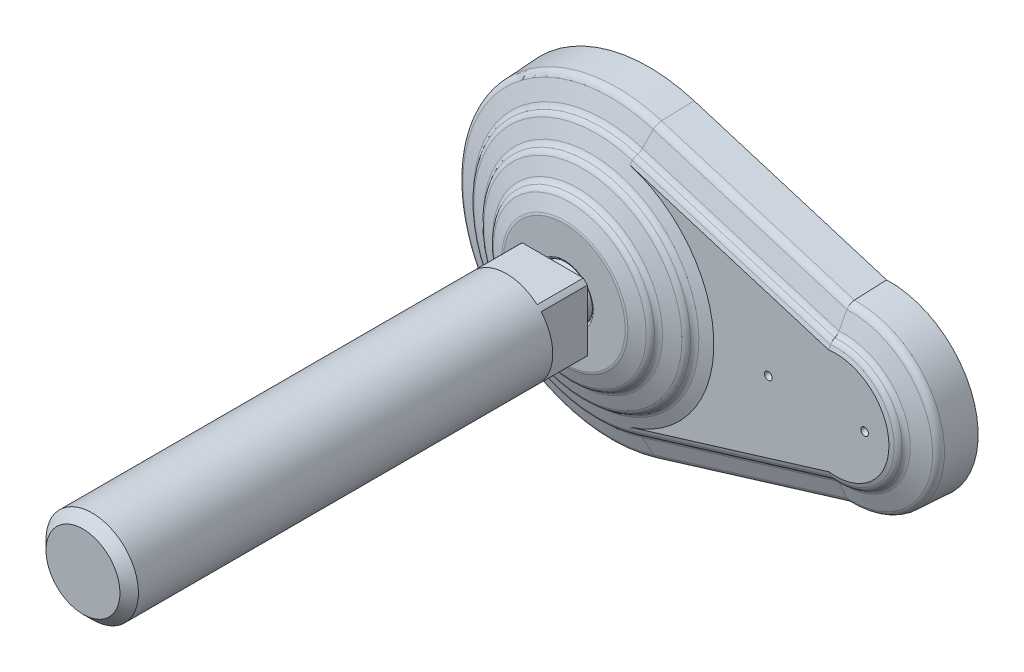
ISO-10303-21;
HEADER;
FILE_DESCRIPTION(('STEP AP214'),'2;1');
FILE_NAME('part.step','',(''),(''),'','','');
FILE_SCHEMA(('AUTOMOTIVE_DESIGN { 1 0 10303 214 1 1 1 1 }'));
ENDSEC;
DATA;
#1=APPLICATION_CONTEXT('core data for automotive mechanical design processes');
#2=APPLICATION_PROTOCOL_DEFINITION('international standard','automotive_design',2000,#1);
#3=PRODUCT_CONTEXT('',#1,'mechanical');
#4=PRODUCT('Part','Part','',(#3));
#5=PRODUCT_RELATED_PRODUCT_CATEGORY('part','',(#4));
#6=PRODUCT_DEFINITION_FORMATION('','',#4);
#7=PRODUCT_DEFINITION_CONTEXT('part definition',#1,'design');
#8=PRODUCT_DEFINITION('design','',#6,#7);
#9=PRODUCT_DEFINITION_SHAPE('','',#8);
#10=(LENGTH_UNIT() NAMED_UNIT(*) SI_UNIT(.MILLI.,.METRE.));
#11=(NAMED_UNIT(*) PLANE_ANGLE_UNIT() SI_UNIT($,.RADIAN.));
#12=(NAMED_UNIT(*) SI_UNIT($,.STERADIAN.) SOLID_ANGLE_UNIT());
#13=UNCERTAINTY_MEASURE_WITH_UNIT(LENGTH_MEASURE(1.E-05),#10,'distance_accuracy_value','');
#14=(GEOMETRIC_REPRESENTATION_CONTEXT(3) GLOBAL_UNCERTAINTY_ASSIGNED_CONTEXT((#13)) GLOBAL_UNIT_ASSIGNED_CONTEXT((#10,
#11,#12)) REPRESENTATION_CONTEXT('',''));
#15=CARTESIAN_POINT('',(0.,0.,0.));
#16=DIRECTION('',(0.,0.,1.));
#17=DIRECTION('',(1.,0.,0.));
#18=AXIS2_PLACEMENT_3D('',#15,#16,#17);
#19=CARTESIAN_POINT('',(0.,0.,37.));
#20=DIRECTION('',(0.,0.,1.));
#21=DIRECTION('',(-1.,0.,0.));
#22=AXIS2_PLACEMENT_3D('',#19,#20,#21);
#23=CYLINDRICAL_SURFACE('',#22,12.);
#24=CARTESIAN_POINT('',(0.,0.,144.6));
#25=DIRECTION('',(0.,0.,1.));
#26=DIRECTION('',(-1.,0.,0.));
#27=AXIS2_PLACEMENT_3D('',#24,#25,#26);
#28=CIRCLE('',#27,12.);
#29=CARTESIAN_POINT('',(-12.,0.,144.6));
#30=VERTEX_POINT('',#29);
#31=EDGE_CURVE('E9',#30,#30,#28,.F.);
#32=ORIENTED_EDGE('',*,*,#31,.T.);
#33=EDGE_LOOP('',(#32));
#34=FACE_BOUND('',#33,.T.);
#35=DIRECTION('',(0.,0.,1.));
#36=VECTOR('',#35,1.);
#37=CARTESIAN_POINT('',(-7.93725393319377,-9.,37.));
#38=LINE('',#37,#36);
#39=CARTESIAN_POINT('',(-7.93725393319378,-9.,37.));
#40=VERTEX_POINT('',#39);
#41=CARTESIAN_POINT('',(-7.93725393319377,-9.,25.));
#42=VERTEX_POINT('',#41);
#43=EDGE_CURVE('E135',#40,#42,#38,.F.);
#44=ORIENTED_EDGE('',*,*,#43,.F.);
#45=CARTESIAN_POINT('',(0.,0.,37.));
#46=DIRECTION('',(0.,0.,1.));
#47=DIRECTION('',(0.,-1.,0.));
#48=AXIS2_PLACEMENT_3D('',#45,#46,#47);
#49=CIRCLE('',#48,12.);
#50=CARTESIAN_POINT('',(7.93725393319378,-9.,37.));
#51=VERTEX_POINT('',#50);
#52=EDGE_CURVE('E506',#40,#51,#49,.T.);
#53=ORIENTED_EDGE('',*,*,#52,.T.);
#54=DIRECTION('',(0.,0.,1.));
#55=VECTOR('',#54,1.);
#56=CARTESIAN_POINT('',(7.93725393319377,-9.,37.));
#57=LINE('',#56,#55);
#58=CARTESIAN_POINT('',(7.93725393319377,-9.,25.));
#59=VERTEX_POINT('',#58);
#60=EDGE_CURVE('E200',#59,#51,#57,.T.);
#61=ORIENTED_EDGE('',*,*,#60,.F.);
#62=CARTESIAN_POINT('',(0.,0.,25.));
#63=DIRECTION('',(0.,0.,1.));
#64=DIRECTION('',(-1.,0.,0.));
#65=AXIS2_PLACEMENT_3D('',#62,#63,#64);
#66=CIRCLE('',#65,12.);
#67=CARTESIAN_POINT('',(9.,-7.93725393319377,25.));
#68=VERTEX_POINT('',#67);
#69=EDGE_CURVE('E183',#59,#68,#66,.T.);
#70=ORIENTED_EDGE('',*,*,#69,.T.);
#71=DIRECTION('',(0.,0.,1.));
#72=VECTOR('',#71,1.);
#73=CARTESIAN_POINT('',(9.,-7.93725393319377,37.));
#74=LINE('',#73,#72);
#75=CARTESIAN_POINT('',(9.,-7.93725393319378,37.));
#76=VERTEX_POINT('',#75);
#77=EDGE_CURVE('E197',#76,#68,#74,.F.);
#78=ORIENTED_EDGE('',*,*,#77,.F.);
#79=CARTESIAN_POINT('',(9.,7.93725393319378,37.));
#80=VERTEX_POINT('',#79);
#81=EDGE_CURVE('E265',#76,#80,#49,.T.);
#82=ORIENTED_EDGE('',*,*,#81,.T.);
#83=DIRECTION('',(0.,0.,1.));
#84=VECTOR('',#83,1.);
#85=CARTESIAN_POINT('',(9.,7.93725393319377,37.));
#86=LINE('',#85,#84);
#87=CARTESIAN_POINT('',(9.,7.93725393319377,25.));
#88=VERTEX_POINT('',#87);
#89=EDGE_CURVE('E242',#88,#80,#86,.T.);
#90=ORIENTED_EDGE('',*,*,#89,.F.);
#91=CARTESIAN_POINT('',(7.93725393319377,9.,25.));
#92=VERTEX_POINT('',#91);
#93=EDGE_CURVE('E179',#88,#92,#66,.T.);
#94=ORIENTED_EDGE('',*,*,#93,.T.);
#95=DIRECTION('',(0.,0.,1.));
#96=VECTOR('',#95,1.);
#97=CARTESIAN_POINT('',(7.93725393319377,9.,37.));
#98=LINE('',#97,#96);
#99=CARTESIAN_POINT('',(7.93725393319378,9.,37.));
#100=VERTEX_POINT('',#99);
#101=EDGE_CURVE('E160',#100,#92,#98,.F.);
#102=ORIENTED_EDGE('',*,*,#101,.F.);
#103=CARTESIAN_POINT('',(-7.93725393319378,9.,37.));
#104=VERTEX_POINT('',#103);
#105=EDGE_CURVE('E173',#100,#104,#49,.T.);
#106=ORIENTED_EDGE('',*,*,#105,.T.);
#107=DIRECTION('',(0.,0.,1.));
#108=VECTOR('',#107,1.);
#109=CARTESIAN_POINT('',(-7.93725393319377,9.,37.));
#110=LINE('',#109,#108);
#111=CARTESIAN_POINT('',(-7.93725393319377,9.,25.));
#112=VERTEX_POINT('',#111);
#113=EDGE_CURVE('E158',#112,#104,#110,.T.);
#114=ORIENTED_EDGE('',*,*,#113,.F.);
#115=CARTESIAN_POINT('',(-9.,7.93725393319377,25.));
#116=VERTEX_POINT('',#115);
#117=EDGE_CURVE('E171',#112,#116,#66,.T.);
#118=ORIENTED_EDGE('',*,*,#117,.T.);
#119=DIRECTION('',(0.,0.,1.));
#120=VECTOR('',#119,1.);
#121=CARTESIAN_POINT('',(-9.,7.93725393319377,37.));
#122=LINE('',#121,#120);
#123=CARTESIAN_POINT('',(-9.,7.93725393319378,37.));
#124=VERTEX_POINT('',#123);
#125=EDGE_CURVE('E174',#124,#116,#122,.F.);
#126=ORIENTED_EDGE('',*,*,#125,.F.);
#127=CARTESIAN_POINT('',(-9.,-7.93725393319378,37.));
#128=VERTEX_POINT('',#127);
#129=EDGE_CURVE('E516',#124,#128,#49,.T.);
#130=ORIENTED_EDGE('',*,*,#129,.T.);
#131=DIRECTION('',(0.,0.,1.));
#132=VECTOR('',#131,1.);
#133=CARTESIAN_POINT('',(-9.,-7.93725393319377,37.));
#134=LINE('',#133,#132);
#135=CARTESIAN_POINT('',(-9.,-7.93725393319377,25.));
#136=VERTEX_POINT('',#135);
#137=EDGE_CURVE('E180',#136,#128,#134,.T.);
#138=ORIENTED_EDGE('',*,*,#137,.F.);
#139=EDGE_CURVE('E182',#136,#42,#66,.T.);
#140=ORIENTED_EDGE('',*,*,#139,.T.);
#141=EDGE_LOOP('',(#44,#53,#61,#70,#78,#82,#90,#94,#102,#106,#114,#118,#126,#130,#138,#140));
#142=FACE_BOUND('',#141,.T.);
#143=ADVANCED_FACE('F14',(#34,#142),#23,.T.);
#144=CARTESIAN_POINT('',(-5.26544933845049,0.,25.));
#145=DIRECTION('',(0.,0.,1.));
#146=DIRECTION('',(-1.,0.,0.));
#147=AXIS2_PLACEMENT_3D('',#144,#145,#146);
#148=PLANE('',#147);
#149=DIRECTION('',(0.,-1.,0.));
#150=VECTOR('',#149,1.);
#151=CARTESIAN_POINT('',(-9.,9.,25.));
#152=LINE('',#151,#150);
#153=EDGE_CURVE('E31',#116,#136,#152,.T.);
#154=ORIENTED_EDGE('',*,*,#153,.F.);
#155=ORIENTED_EDGE('',*,*,#117,.F.);
#156=DIRECTION('',(-1.,0.,0.));
#157=VECTOR('',#156,1.);
#158=CARTESIAN_POINT('',(9.,9.,25.));
#159=LINE('',#158,#157);
#160=EDGE_CURVE('E153',#92,#112,#159,.T.);
#161=ORIENTED_EDGE('',*,*,#160,.F.);
#162=ORIENTED_EDGE('',*,*,#93,.F.);
#163=DIRECTION('',(0.,1.,0.));
#164=VECTOR('',#163,1.);
#165=CARTESIAN_POINT('',(9.,-9.,25.));
#166=LINE('',#165,#164);
#167=EDGE_CURVE('E165',#68,#88,#166,.T.);
#168=ORIENTED_EDGE('',*,*,#167,.F.);
#169=ORIENTED_EDGE('',*,*,#69,.F.);
#170=DIRECTION('',(1.,0.,0.));
#171=VECTOR('',#170,1.);
#172=CARTESIAN_POINT('',(-9.,-9.,25.));
#173=LINE('',#172,#171);
#174=EDGE_CURVE('E202',#42,#59,#173,.T.);
#175=ORIENTED_EDGE('',*,*,#174,.F.);
#176=ORIENTED_EDGE('',*,*,#139,.F.);
#177=EDGE_LOOP('',(#154,#155,#161,#162,#168,#169,#175,#176));
#178=FACE_BOUND('',#177,.T.);
#179=CARTESIAN_POINT('',(0.,0.,25.));
#180=DIRECTION('',(0.,0.,1.));
#181=DIRECTION('',(-1.,0.,0.));
#182=AXIS2_PLACEMENT_3D('',#179,#180,#181);
#183=CIRCLE('',#182,5.26544933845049);
#184=CARTESIAN_POINT('',(-5.26544933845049,0.,25.));
#185=VERTEX_POINT('',#184);
#186=EDGE_CURVE('E188',#185,#185,#183,.T.);
#187=ORIENTED_EDGE('',*,*,#186,.T.);
#188=EDGE_LOOP('',(#187));
#189=FACE_BOUND('',#188,.T.);
#190=ADVANCED_FACE('F176',(#178,#189),#148,.F.);
#191=CARTESIAN_POINT('',(0.,0.,18.6509999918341));
#192=DIRECTION('',(0.,0.,1.));
#193=DIRECTION('',(-1.,0.,0.));
#194=AXIS2_PLACEMENT_3D('',#191,#192,#193);
#195=DEGENERATE_TOROIDAL_SURFACE('',#194,0.000333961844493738,6.829,.T.);
#196=CARTESIAN_POINT('',(0.,0.,19.794));
#197=DIRECTION('',(0.,0.,-1.));
#198=DIRECTION('',(1.,0.,0.));
#199=AXIS2_PLACEMENT_3D('',#196,#197,#198);
#200=CIRCLE('',#199,6.733);
#201=CARTESIAN_POINT('',(6.733,0.,19.794));
#202=VERTEX_POINT('',#201);
#203=EDGE_CURVE('E249',#202,#202,#200,.T.);
#204=ORIENTED_EDGE('',*,*,#203,.F.);
#205=EDGE_LOOP('',(#204));
#206=FACE_BOUND('',#205,.T.);
#207=CARTESIAN_POINT('',(0.,0.,23.));
#208=DIRECTION('',(0.,0.,1.));
#209=DIRECTION('',(-1.,0.,0.));
#210=AXIS2_PLACEMENT_3D('',#207,#208,#209);
#211=CIRCLE('',#210,5.2654493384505);
#212=CARTESIAN_POINT('',(-5.2654493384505,0.,23.));
#213=VERTEX_POINT('',#212);
#214=EDGE_CURVE('E190',#213,#213,#211,.T.);
#215=ORIENTED_EDGE('',*,*,#214,.F.);
#216=EDGE_LOOP('',(#215));
#217=FACE_BOUND('',#216,.T.);
#218=ADVANCED_FACE('F450',(#206,#217),#195,.T.);
#219=CARTESIAN_POINT('',(0.,0.,37.));
#220=DIRECTION('',(0.,0.,1.));
#221=DIRECTION('',(-1.,0.,0.));
#222=AXIS2_PLACEMENT_3D('',#219,#220,#221);
#223=CYLINDRICAL_SURFACE('',#222,5.2654493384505);
#224=ORIENTED_EDGE('',*,*,#186,.F.);
#225=EDGE_LOOP('',(#224));
#226=FACE_BOUND('',#225,.T.);
#227=ORIENTED_EDGE('',*,*,#214,.T.);
#228=EDGE_LOOP('',(#227));
#229=FACE_BOUND('',#228,.T.);
#230=ADVANCED_FACE('F529',(#226,#229),#223,.T.);
#231=CARTESIAN_POINT('',(-9.,-9.,25.));
#232=DIRECTION('',(0.,-1.,0.));
#233=DIRECTION('',(1.,0.,0.));
#234=AXIS2_PLACEMENT_3D('',#231,#232,#233);
#235=PLANE('',#234);
#236=ORIENTED_EDGE('',*,*,#60,.T.);
#237=DIRECTION('',(-1.,0.,0.));
#238=VECTOR('',#237,1.);
#239=CARTESIAN_POINT('',(-12.,-9.,37.));
#240=LINE('',#239,#238);
#241=EDGE_CURVE('E214',#51,#40,#240,.T.);
#242=ORIENTED_EDGE('',*,*,#241,.T.);
#243=ORIENTED_EDGE('',*,*,#43,.T.);
#244=ORIENTED_EDGE('',*,*,#174,.T.);
#245=EDGE_LOOP('',(#236,#242,#243,#244));
#246=FACE_BOUND('',#245,.T.);
#247=ADVANCED_FACE('F525',(#246),#235,.T.);
#248=CARTESIAN_POINT('',(9.,-9.,25.));
#249=DIRECTION('',(1.,0.,0.));
#250=DIRECTION('',(0.,1.,0.));
#251=AXIS2_PLACEMENT_3D('',#248,#249,#250);
#252=PLANE('',#251);
#253=ORIENTED_EDGE('',*,*,#89,.T.);
#254=DIRECTION('',(0.,-1.,0.));
#255=VECTOR('',#254,1.);
#256=CARTESIAN_POINT('',(9.,0.,37.));
#257=LINE('',#256,#255);
#258=EDGE_CURVE('E221',#80,#76,#257,.T.);
#259=ORIENTED_EDGE('',*,*,#258,.T.);
#260=ORIENTED_EDGE('',*,*,#77,.T.);
#261=ORIENTED_EDGE('',*,*,#167,.T.);
#262=EDGE_LOOP('',(#253,#259,#260,#261));
#263=FACE_BOUND('',#262,.T.);
#264=ADVANCED_FACE('F540',(#263),#252,.T.);
#265=CARTESIAN_POINT('',(9.,9.,25.));
#266=DIRECTION('',(0.,1.,0.));
#267=DIRECTION('',(-1.,0.,0.));
#268=AXIS2_PLACEMENT_3D('',#265,#266,#267);
#269=PLANE('',#268);
#270=ORIENTED_EDGE('',*,*,#113,.T.);
#271=DIRECTION('',(1.,0.,0.));
#272=VECTOR('',#271,1.);
#273=CARTESIAN_POINT('',(-12.,9.,37.));
#274=LINE('',#273,#272);
#275=EDGE_CURVE('E225',#104,#100,#274,.T.);
#276=ORIENTED_EDGE('',*,*,#275,.T.);
#277=ORIENTED_EDGE('',*,*,#101,.T.);
#278=ORIENTED_EDGE('',*,*,#160,.T.);
#279=EDGE_LOOP('',(#270,#276,#277,#278));
#280=FACE_BOUND('',#279,.T.);
#281=ADVANCED_FACE('F155',(#280),#269,.T.);
#282=CARTESIAN_POINT('',(-9.,9.,25.));
#283=DIRECTION('',(-1.,0.,0.));
#284=DIRECTION('',(0.,-1.,0.));
#285=AXIS2_PLACEMENT_3D('',#282,#283,#284);
#286=PLANE('',#285);
#287=ORIENTED_EDGE('',*,*,#137,.T.);
#288=DIRECTION('',(0.,1.,0.));
#289=VECTOR('',#288,1.);
#290=CARTESIAN_POINT('',(-9.,0.,37.));
#291=LINE('',#290,#289);
#292=EDGE_CURVE('E238',#128,#124,#291,.T.);
#293=ORIENTED_EDGE('',*,*,#292,.T.);
#294=ORIENTED_EDGE('',*,*,#125,.T.);
#295=ORIENTED_EDGE('',*,*,#153,.T.);
#296=EDGE_LOOP('',(#287,#293,#294,#295));
#297=FACE_BOUND('',#296,.T.);
#298=ADVANCED_FACE('F461',(#297),#286,.T.);
#299=CARTESIAN_POINT('',(62.5,0.,0.));
#300=DIRECTION('',(0.,0.,-1.));
#301=DIRECTION('',(0.,1.,0.));
#302=AXIS2_PLACEMENT_3D('',#299,#300,#301);
#303=CONICAL_SURFACE('',#302,22.9787234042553,0.0523365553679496);
#304=CARTESIAN_POINT('',(62.5,0.,8.30411735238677));
#305=DIRECTION('',(0.,0.,1.));
#306=DIRECTION('',(0.,-1.,0.));
#307=AXIS2_PLACEMENT_3D('',#304,#305,#306);
#308=CIRCLE('',#307,22.5437172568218);
#309=CARTESIAN_POINT('',(61.6407011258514,-22.5273343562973,8.30411735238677));
#310=VERTEX_POINT('',#309);
#311=CARTESIAN_POINT('',(61.6407011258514,22.5273343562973,8.30411735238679));
#312=VERTEX_POINT('',#311);
#313=EDGE_CURVE('E284',#310,#312,#308,.T.);
#314=ORIENTED_EDGE('',*,*,#313,.F.);
#315=CARTESIAN_POINT('',(61.6406997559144,-22.5273238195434,8.30431735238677));
#316=CARTESIAN_POINT('',(61.6501805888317,-22.600242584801,6.92023165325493));
#317=CARTESIAN_POINT('',(61.6596900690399,-22.6731526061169,5.53614569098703));
#318=CARTESIAN_POINT('',(61.6787663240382,-22.8189551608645,2.76797324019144));
#319=CARTESIAN_POINT('',(61.6883330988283,-22.8918476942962,1.38388675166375));
#320=CARTESIAN_POINT('',(61.6979285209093,-22.9647314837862,-0.00020000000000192));
#321=B_SPLINE_CURVE_WITH_KNOTS('',3,(#315,#316,#317,#318,#319,#320),.UNSPECIFIED.,.F.,.F.,(4,2,
4),(0.,4.15811282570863,8.31622565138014),.UNSPECIFIED.);
#322=CARTESIAN_POINT('',(61.697927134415,-22.9647209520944,0.));
#323=VERTEX_POINT('',#322);
#324=EDGE_CURVE('E691',#310,#323,#321,.T.);
#325=ORIENTED_EDGE('',*,*,#324,.T.);
#326=CARTESIAN_POINT('',(62.5,0.,0.));
#327=DIRECTION('',(0.,0.,1.));
#328=DIRECTION('',(0.,-1.,0.));
#329=AXIS2_PLACEMENT_3D('',#326,#327,#328);
#330=CIRCLE('',#329,22.9787234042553);
#331=CARTESIAN_POINT('',(61.6979271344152,22.9647209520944,0.));
#332=VERTEX_POINT('',#331);
#333=EDGE_CURVE('E286',#323,#332,#330,.T.);
#334=ORIENTED_EDGE('',*,*,#333,.T.);
#335=CARTESIAN_POINT('',(61.6979285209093,22.9647314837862,-0.00019999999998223));
#336=CARTESIAN_POINT('',(61.6883330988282,22.8918476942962,1.38388675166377));
#337=CARTESIAN_POINT('',(61.6787663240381,22.8189551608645,2.76797324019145));
#338=CARTESIAN_POINT('',(61.6596900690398,22.6731526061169,5.53614569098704));
#339=CARTESIAN_POINT('',(61.6501805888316,22.600242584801,6.92023165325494));
#340=CARTESIAN_POINT('',(61.6406997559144,22.5273238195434,8.30431735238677));
#341=B_SPLINE_CURVE_WITH_KNOTS('',3,(#335,#336,#337,#338,#339,#340),.UNSPECIFIED.,.F.,.F.,(4,2,
4),(0.,4.1581128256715,8.31622565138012),.UNSPECIFIED.);
#342=EDGE_CURVE('E700',#332,#312,#341,.T.);
#343=ORIENTED_EDGE('',*,*,#342,.T.);
#344=EDGE_LOOP('',(#314,#325,#334,#343));
#345=FACE_BOUND('',#344,.T.);
#346=ADVANCED_FACE('F455',(#345),#303,.T.);
#347=CARTESIAN_POINT('',(64.1644462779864,-21.755748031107,8.30411735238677));
#348=DIRECTION('',(-0.291971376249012,0.9549953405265,-0.0523126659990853));
#349=DIRECTION('',(-0.956304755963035,-0.292371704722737,0.));
#350=AXIS2_PLACEMENT_3D('',#347,#348,#349);
#351=PLANE('',#350);
#352=ORIENTED_EDGE('',*,*,#324,.F.);
#353=DIRECTION('',(-0.956304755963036,-0.292371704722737,0.));
#354=VECTOR('',#353,1.);
#355=CARTESIAN_POINT('',(64.1644462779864,-21.755748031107,8.30411735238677));
#356=LINE('',#355,#354);
#357=CARTESIAN_POINT('',(11.5676847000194,-37.8361917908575,8.30411735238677));
#358=VERTEX_POINT('',#357);
#359=EDGE_CURVE('E620',#310,#358,#356,.T.);
#360=ORIENTED_EDGE('',*,*,#359,.T.);
#361=DIRECTION('',(-0.0152947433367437,0.050026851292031,0.998630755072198));
#362=VECTOR('',#361,1.);
#363=CARTESIAN_POINT('',(11.6948681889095,-38.2521902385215,0.));
#364=LINE('',#363,#362);
#365=CARTESIAN_POINT('',(11.6948681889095,-38.2521902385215,0.));
#366=VERTEX_POINT('',#365);
#367=EDGE_CURVE('E633',#366,#358,#364,.T.);
#368=ORIENTED_EDGE('',*,*,#367,.F.);
#369=DIRECTION('',(-0.956304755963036,-0.292371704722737,0.));
#370=VECTOR('',#369,1.);
#371=CARTESIAN_POINT('',(64.2916297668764,-22.1717464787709,0.));
#372=LINE('',#371,#370);
#373=EDGE_CURVE('E126',#323,#366,#372,.T.);
#374=ORIENTED_EDGE('',*,*,#373,.F.);
#375=EDGE_LOOP('',(#352,#360,#368,#374));
#376=FACE_BOUND('',#375,.T.);
#377=ADVANCED_FACE('F446',(#376),#351,.F.);
#378=CARTESIAN_POINT('',(0.,0.,0.));
#379=DIRECTION('',(0.,0.,1.));
#380=DIRECTION('',(-1.,0.,0.));
#381=AXIS2_PLACEMENT_3D('',#378,#379,#380);
#382=PLANE('',#381);
#383=DIRECTION('',(-0.956304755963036,0.292371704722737,0.));
#384=VECTOR('',#383,1.);
#385=CARTESIAN_POINT('',(64.2916297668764,22.1717464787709,0.));
#386=LINE('',#385,#384);
#387=CARTESIAN_POINT('',(11.6948681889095,38.2521902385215,0.));
#388=VERTEX_POINT('',#387);
#389=EDGE_CURVE('E618',#332,#388,#386,.T.);
#390=ORIENTED_EDGE('',*,*,#389,.F.);
#391=ORIENTED_EDGE('',*,*,#333,.F.);
#392=ORIENTED_EDGE('',*,*,#373,.T.);
#393=CARTESIAN_POINT('',(0.,0.,0.));
#394=DIRECTION('',(0.,0.,1.));
#395=DIRECTION('',(-1.,0.,0.));
#396=AXIS2_PLACEMENT_3D('',#393,#394,#395);
#397=CIRCLE('',#396,40.);
#398=EDGE_CURVE('E327',#388,#366,#397,.T.);
#399=ORIENTED_EDGE('',*,*,#398,.F.);
#400=EDGE_LOOP('',(#390,#391,#392,#399));
#401=FACE_BOUND('',#400,.T.);
#402=CARTESIAN_POINT('',(45.,0.,0.));
#403=DIRECTION('',(0.,0.,-1.));
#404=DIRECTION('',(0.,1.,0.));
#405=AXIS2_PLACEMENT_3D('',#402,#403,#404);
#406=CIRCLE('',#405,5.25);
#407=CARTESIAN_POINT('',(45.,5.25,0.));
#408=VERTEX_POINT('',#407);
#409=EDGE_CURVE('E503',#408,#408,#406,.T.);
#410=ORIENTED_EDGE('',*,*,#409,.F.);
#411=EDGE_LOOP('',(#410));
#412=FACE_BOUND('',#411,.T.);
#413=CARTESIAN_POINT('',(70.,0.,0.));
#414=DIRECTION('',(0.,0.,-1.));
#415=DIRECTION('',(0.,1.,0.));
#416=AXIS2_PLACEMENT_3D('',#413,#414,#415);
#417=CIRCLE('',#416,5.25);
#418=CARTESIAN_POINT('',(70.,5.25,0.));
#419=VERTEX_POINT('',#418);
#420=EDGE_CURVE('E500',#419,#419,#417,.T.);
#421=ORIENTED_EDGE('',*,*,#420,.F.);
#422=EDGE_LOOP('',(#421));
#423=FACE_BOUND('',#422,.T.);
#424=ADVANCED_FACE('F336',(#401,#412,#423),#382,.F.);
#425=CARTESIAN_POINT('',(64.2916297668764,22.1717464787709,0.));
#426=DIRECTION('',(-0.291971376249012,-0.9549953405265,-0.0523126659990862));
#427=DIRECTION('',(0.956304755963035,-0.292371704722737,0.));
#428=AXIS2_PLACEMENT_3D('',#425,#426,#427);
#429=PLANE('',#428);
#430=ORIENTED_EDGE('',*,*,#342,.F.);
#431=ORIENTED_EDGE('',*,*,#389,.T.);
#432=DIRECTION('',(-0.0152947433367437,-0.050026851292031,0.998630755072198));
#433=VECTOR('',#432,1.);
#434=CARTESIAN_POINT('',(11.6948681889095,38.2521902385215,0.));
#435=LINE('',#434,#433);
#436=CARTESIAN_POINT('',(11.5676847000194,37.8361917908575,8.30411735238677));
#437=VERTEX_POINT('',#436);
#438=EDGE_CURVE('E651',#388,#437,#435,.T.);
#439=ORIENTED_EDGE('',*,*,#438,.T.);
#440=DIRECTION('',(-0.956304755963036,0.292371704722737,0.));
#441=VECTOR('',#440,1.);
#442=CARTESIAN_POINT('',(64.1644462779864,21.755748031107,8.30411735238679));
#443=LINE('',#442,#441);
#444=EDGE_CURVE('E616',#312,#437,#443,.T.);
#445=ORIENTED_EDGE('',*,*,#444,.F.);
#446=EDGE_LOOP('',(#430,#431,#439,#445));
#447=FACE_BOUND('',#446,.T.);
#448=ADVANCED_FACE('F416',(#447),#429,.F.);
#449=CARTESIAN_POINT('',(62.5,0.,8.19912580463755));
#450=DIRECTION('',(0.,0.,1.));
#451=DIRECTION('',(0.,-1.,0.));
#452=AXIS2_PLACEMENT_3D('',#449,#450,#451);
#453=TOROIDAL_SURFACE('',#452,20.5394653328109,2.007);
#454=CARTESIAN_POINT('',(61.6407233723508,-22.5275054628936,8.09743405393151));
#455=CARTESIAN_POINT('',(61.6409510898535,-22.5292569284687,8.13179934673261));
#456=CARTESIAN_POINT('',(61.6410635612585,-22.5301219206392,8.16619641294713));
#457=CARTESIAN_POINT('',(61.6410572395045,-22.5300732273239,8.23504586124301));
#458=CARTESIAN_POINT('',(61.6409380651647,-22.5291566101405,8.26949824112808));
#459=CARTESIAN_POINT('',(61.6399396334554,-22.5214778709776,8.41537858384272));
#460=CARTESIAN_POINT('',(61.6379561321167,-22.5062239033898,8.52649092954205));
#461=CARTESIAN_POINT('',(61.6316126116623,-22.4573679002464,8.74462326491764));
#462=CARTESIAN_POINT('',(61.6272490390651,-22.4237384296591,8.85163687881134));
#463=CARTESIAN_POINT('',(61.6163034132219,-22.339189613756,9.05835724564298));
#464=CARTESIAN_POINT('',(61.6097238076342,-22.2882893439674,9.1580719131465));
#465=CARTESIAN_POINT('',(61.5945702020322,-22.1707054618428,9.34754679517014));
#466=CARTESIAN_POINT('',(61.5859960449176,-22.1040206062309,9.43730622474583));
#467=CARTESIAN_POINT('',(61.5670698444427,-21.9562760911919,9.60507832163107));
#468=CARTESIAN_POINT('',(61.5567047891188,-21.8751110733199,9.68299656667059));
#469=CARTESIAN_POINT('',(61.5345911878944,-21.7011851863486,9.82410142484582));
#470=CARTESIAN_POINT('',(61.5228449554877,-21.6084436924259,9.88731215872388));
#471=CARTESIAN_POINT('',(61.5046129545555,-21.4637836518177,9.96928669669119));
#472=CARTESIAN_POINT('',(61.4985079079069,-21.4152343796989,9.99425235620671));
#473=CARTESIAN_POINT('',(61.4860940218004,-21.3162718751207,10.0401972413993));
#474=CARTESIAN_POINT('',(61.4797850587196,-21.2658575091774,10.0611739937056));
#475=CARTESIAN_POINT('',(61.4596293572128,-21.1043762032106,10.1208327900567));
#476=CARTESIAN_POINT('',(61.4454888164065,-20.9904779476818,10.1519983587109));
#477=CARTESIAN_POINT('',(61.4169436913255,-20.7591475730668,10.1941665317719));
#478=CARTESIAN_POINT('',(61.4025394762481,-20.6417202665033,10.2051954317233));
#479=CARTESIAN_POINT('',(61.3876252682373,-20.5193667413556,10.2061070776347));
#480=CARTESIAN_POINT('',(61.3870090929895,-20.5143103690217,10.2061258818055));
#481=CARTESIAN_POINT('',(61.3863931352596,-20.5092543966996,10.2061258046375));
#482=B_SPLINE_CURVE_WITH_KNOTS('',3,(#454,#455,#456,#457,#458,#459,#460,#461,#462,#463,#464,
#465,#466,#467,#468,#469,#470,#471,#472,#473,#474,#475,#476,#477,#478,#479,#480,#481),
.UNSPECIFIED.,.F.,.F.,(4,2,2,2,2,2,2,2,2,2,2,2,2,4),(0.,0.103191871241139,0.20655369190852,
0.54127575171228,0.87649892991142,1.21135305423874,1.54623356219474,1.88365820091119,
2.2205254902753,2.38517216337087,2.54992059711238,2.90486008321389,3.2593357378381,
3.2746170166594),.UNSPECIFIED.);
#483=CARTESIAN_POINT('',(61.4734629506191,-21.2152067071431,10.0798866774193));
#484=VERTEX_POINT('',#483);
#485=EDGE_CURVE('E693',#310,#484,#482,.T.);
#486=ORIENTED_EDGE('',*,*,#485,.F.);
#487=ORIENTED_EDGE('',*,*,#313,.T.);
#488=CARTESIAN_POINT('',(61.3863931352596,20.5092543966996,10.2061258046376));
#489=CARTESIAN_POINT('',(61.3870091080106,20.5143104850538,10.2061258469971));
#490=CARTESIAN_POINT('',(61.3876252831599,20.5193668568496,10.206107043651));
#491=CARTESIAN_POINT('',(61.3988855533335,20.6117442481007,10.2054193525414));
#492=CARTESIAN_POINT('',(61.4095840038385,20.6991031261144,10.1991511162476));
#493=CARTESIAN_POINT('',(61.4308936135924,20.8723273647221,10.1754412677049));
#494=CARTESIAN_POINT('',(61.4415047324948,20.9581920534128,10.1579947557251));
#495=CARTESIAN_POINT('',(61.4555813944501,21.0716202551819,10.1272225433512));
#496=CARTESIAN_POINT('',(61.4591730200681,21.1005182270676,10.1186877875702));
#497=CARTESIAN_POINT('',(61.4663157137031,21.1579059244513,10.1003430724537));
#498=CARTESIAN_POINT('',(61.4698667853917,21.1863956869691,10.090533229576));
#499=CARTESIAN_POINT('',(61.4866782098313,21.3210820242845,10.0407628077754));
#500=CARTESIAN_POINT('',(61.4996430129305,21.4243838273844,9.99241683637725));
#501=CARTESIAN_POINT('',(61.5245148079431,21.6216549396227,9.87891981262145));
#502=CARTESIAN_POINT('',(61.5364193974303,21.7156031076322,9.81373183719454));
#503=CARTESIAN_POINT('',(61.5587594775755,21.8912250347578,9.66834297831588));
#504=CARTESIAN_POINT('',(61.5691956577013,21.9729045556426,9.58814918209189));
#505=CARTESIAN_POINT('',(61.5882470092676,22.1215501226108,9.41495435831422));
#506=CARTESIAN_POINT('',(61.5968625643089,22.1885192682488,9.32195603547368));
#507=CARTESIAN_POINT('',(61.6119005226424,22.3051440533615,9.12674801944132));
#508=CARTESIAN_POINT('',(61.6183432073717,22.3549598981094,9.02463544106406));
#509=CARTESIAN_POINT('',(61.6289130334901,22.4365717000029,8.81343456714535));
#510=CARTESIAN_POINT('',(61.6330436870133,22.4683949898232,8.70435713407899));
#511=CARTESIAN_POINT('',(61.6371976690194,22.5003783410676,8.54571963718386));
#512=CARTESIAN_POINT('',(61.6382205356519,22.5082502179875,8.49762935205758));
#513=CARTESIAN_POINT('',(61.639806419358,22.5204527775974,8.40103137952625));
#514=CARTESIAN_POINT('',(61.6403698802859,22.52478687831,8.35252414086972));
#515=CARTESIAN_POINT('',(61.6411729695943,22.5309631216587,8.23516417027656));
#516=CARTESIAN_POINT('',(61.641181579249,22.5310278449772,8.16621181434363));
#517=CARTESIAN_POINT('',(61.6407233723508,22.5275054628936,8.09743405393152));
#518=B_SPLINE_CURVE_WITH_KNOTS('',3,(#488,#489,#490,#491,#492,#493,#494,#495,#496,#497,#498,
#499,#500,#501,#502,#503,#504,#505,#506,#507,#508,#509,#510,#511,#512,#513,#514,#515,#516,#517),
.UNSPECIFIED.,.F.,.F.,(4,2,2,2,2,2,2,2,2,2,2,2,2,2,4),(0.,0.0152812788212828,0.27917431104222,
0.543183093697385,0.634194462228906,0.725197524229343,1.06775959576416,1.41107914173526,
1.75423694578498,2.09732237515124,2.43711059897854,2.77638125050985,2.92250118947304,
3.06847978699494,3.27496314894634),.UNSPECIFIED.);
#519=CARTESIAN_POINT('',(61.4734629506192,21.2152067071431,10.0798866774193));
#520=VERTEX_POINT('',#519);
#521=EDGE_CURVE('E405',#520,#312,#518,.T.);
#522=ORIENTED_EDGE('',*,*,#521,.F.);
#523=CARTESIAN_POINT('',(62.5,0.,10.0798866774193));
#524=DIRECTION('',(0.,0.,1.));
#525=DIRECTION('',(0.,-1.,0.));
#526=AXIS2_PLACEMENT_3D('',#523,#524,#525);
#527=CIRCLE('',#526,21.2400276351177);
#528=EDGE_CURVE('E282',#484,#520,#527,.T.);
#529=ORIENTED_EDGE('',*,*,#528,.F.);
#530=EDGE_LOOP('',(#486,#487,#522,#529));
#531=FACE_BOUND('',#530,.T.);
#532=ADVANCED_FACE('F387',(#531),#453,.T.);
#533=CARTESIAN_POINT('',(63.5784597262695,-19.8390723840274,8.19912580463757));
#534=DIRECTION('',(-0.956304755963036,-0.292371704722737,0.));
#535=DIRECTION('',(0.292371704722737,-0.956304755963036,0.));
#536=AXIS2_PLACEMENT_3D('',#533,#534,#535);
#537=CYLINDRICAL_SURFACE('',#536,2.00699999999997);
#538=ORIENTED_EDGE('',*,*,#359,.F.);
#539=ORIENTED_EDGE('',*,*,#485,.T.);
#540=DIRECTION('',(-0.956304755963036,-0.292371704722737,0.));
#541=VECTOR('',#540,1.);
#542=CARTESIAN_POINT('',(63.7832843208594,-20.5090234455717,10.0798866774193));
#543=LINE('',#542,#541);
#544=CARTESIAN_POINT('',(11.1865227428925,-36.5894672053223,10.0798866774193));
#545=VERTEX_POINT('',#544);
#546=EDGE_CURVE('E622',#484,#545,#543,.T.);
#547=ORIENTED_EDGE('',*,*,#546,.T.);
#548=CARTESIAN_POINT('',(10.9816981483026,-35.9195161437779,8.19912580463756));
#549=DIRECTION('',(0.956304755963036,0.292371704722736,0.));
#550=DIRECTION('',(-0.292371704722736,0.956304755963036,0.));
#551=AXIS2_PLACEMENT_3D('',#548,#549,#550);
#552=CIRCLE('',#551,2.007);
#553=EDGE_CURVE('E636',#545,#358,#552,.T.);
#554=ORIENTED_EDGE('',*,*,#553,.T.);
#555=EDGE_LOOP('',(#538,#539,#547,#554));
#556=FACE_BOUND('',#555,.T.);
#557=ADVANCED_FACE('F417',(#556),#537,.T.);
#558=CARTESIAN_POINT('',(0.,0.,0.));
#559=DIRECTION('',(0.,0.,-1.));
#560=DIRECTION('',(1.,0.,0.));
#561=AXIS2_PLACEMENT_3D('',#558,#559,#560);
#562=CONICAL_SURFACE('',#561,40.,0.0523365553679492);
#563=CARTESIAN_POINT('',(0.,0.,8.30411735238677));
#564=DIRECTION('',(0.,0.,1.));
#565=DIRECTION('',(-1.,0.,0.));
#566=AXIS2_PLACEMENT_3D('',#563,#564,#565);
#567=CIRCLE('',#566,39.5649938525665);
#568=EDGE_CURVE('E680',#437,#358,#567,.T.);
#569=ORIENTED_EDGE('',*,*,#568,.F.);
#570=ORIENTED_EDGE('',*,*,#438,.F.);
#571=ORIENTED_EDGE('',*,*,#398,.T.);
#572=ORIENTED_EDGE('',*,*,#367,.T.);
#573=EDGE_LOOP('',(#569,#570,#571,#572));
#574=FACE_BOUND('',#573,.T.);
#575=ADVANCED_FACE('F437',(#574),#562,.T.);
#576=CARTESIAN_POINT('',(63.5784597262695,19.8390723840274,8.1991258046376));
#577=DIRECTION('',(-0.956304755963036,0.292371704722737,0.));
#578=DIRECTION('',(-0.292371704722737,-0.956304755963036,0.));
#579=AXIS2_PLACEMENT_3D('',#576,#577,#578);
#580=CYLINDRICAL_SURFACE('',#579,2.00699999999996);
#581=DIRECTION('',(-0.956304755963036,0.292371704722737,0.));
#582=VECTOR('',#581,1.);
#583=CARTESIAN_POINT('',(63.7832843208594,20.5090234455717,10.0798866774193));
#584=LINE('',#583,#582);
#585=CARTESIAN_POINT('',(11.1865227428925,36.5894672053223,10.0798866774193));
#586=VERTEX_POINT('',#585);
#587=EDGE_CURVE('E614',#520,#586,#584,.T.);
#588=ORIENTED_EDGE('',*,*,#587,.F.);
#589=ORIENTED_EDGE('',*,*,#521,.T.);
#590=ORIENTED_EDGE('',*,*,#444,.T.);
#591=CARTESIAN_POINT('',(10.9816981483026,35.9195161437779,8.19912580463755));
#592=DIRECTION('',(-0.956304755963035,0.292371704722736,0.));
#593=DIRECTION('',(-0.292371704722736,-0.956304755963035,0.));
#594=AXIS2_PLACEMENT_3D('',#591,#592,#593);
#595=CIRCLE('',#594,2.007);
#596=EDGE_CURVE('E654',#586,#437,#595,.T.);
#597=ORIENTED_EDGE('',*,*,#596,.F.);
#598=EDGE_LOOP('',(#588,#589,#590,#597));
#599=FACE_BOUND('',#598,.T.);
#600=ADVANCED_FACE('F345',(#599),#580,.T.);
#601=CARTESIAN_POINT('',(62.5,0.,10.0798866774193));
#602=DIRECTION('',(0.,0.,-1.));
#603=DIRECTION('',(0.,1.,0.));
#604=AXIS2_PLACEMENT_3D('',#601,#602,#603);
#605=CONICAL_SURFACE('',#604,21.2400276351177,1.21422909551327);
#606=CARTESIAN_POINT('',(62.5,0.,11.656251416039));
#607=DIRECTION('',(0.,0.,1.));
#608=DIRECTION('',(0.,-1.,0.));
#609=AXIS2_PLACEMENT_3D('',#606,#607,#608);
#610=CIRCLE('',#609,17.0080484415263);
#611=CARTESIAN_POINT('',(60.9818619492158,-16.9401584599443,11.656251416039));
#612=VERTEX_POINT('',#611);
#613=CARTESIAN_POINT('',(60.9818619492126,16.9401584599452,11.656251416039));
#614=VERTEX_POINT('',#613);
#615=EDGE_CURVE('E280',#612,#614,#610,.T.);
#616=ORIENTED_EDGE('',*,*,#615,.F.);
#617=CARTESIAN_POINT('',(60.9818053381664,-16.9396143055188,11.656451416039));
#618=CARTESIAN_POINT('',(61.0189355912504,-17.2964789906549,11.5252879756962));
#619=CARTESIAN_POINT('',(61.0571375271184,-17.653206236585,11.3940567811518));
#620=CARTESIAN_POINT('',(61.1355151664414,-18.3663907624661,11.1314756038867));
#621=CARTESIAN_POINT('',(61.1756908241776,-18.7228480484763,11.0001256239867));
#622=CARTESIAN_POINT('',(61.2578477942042,-19.435511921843,10.7373183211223));
#623=CARTESIAN_POINT('',(61.2998290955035,-19.7917185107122,10.6058609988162));
#624=CARTESIAN_POINT('',(61.3854616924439,-20.5039033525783,10.3428458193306));
#625=CARTESIAN_POINT('',(61.4291130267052,-20.8598816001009,10.2112879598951));
#626=CARTESIAN_POINT('',(61.4735304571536,-21.2157475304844,10.0796866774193));
#627=B_SPLINE_CURVE_WITH_KNOTS('',3,(#617,#618,#619,#620,#621,#622,#623,#624,#625,#626),
.UNSPECIFIED.,.F.,.F.,(4,2,2,2,4),(0.,1.14603990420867,2.29205327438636,3.43805966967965,
4.58409258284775),.UNSPECIFIED.);
#628=EDGE_CURVE('E397',#612,#484,#627,.T.);
#629=ORIENTED_EDGE('',*,*,#628,.T.);
#630=ORIENTED_EDGE('',*,*,#528,.T.);
#631=CARTESIAN_POINT('',(61.4735304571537,21.2157475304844,10.0796866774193));
#632=CARTESIAN_POINT('',(61.4291130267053,20.8598816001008,10.2112879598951));
#633=CARTESIAN_POINT('',(61.3854616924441,20.5039033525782,10.3428458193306));
#634=CARTESIAN_POINT('',(61.2998290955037,19.7917185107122,10.6058609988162));
#635=CARTESIAN_POINT('',(61.2578477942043,19.435511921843,10.7373183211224));
#636=CARTESIAN_POINT('',(61.1756908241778,18.7228480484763,11.0001256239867));
#637=CARTESIAN_POINT('',(61.1355151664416,18.3663907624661,11.1314756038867));
#638=CARTESIAN_POINT('',(61.0571375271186,17.653206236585,11.3940567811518));
#639=CARTESIAN_POINT('',(61.0189355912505,17.2964789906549,11.5252879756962));
#640=CARTESIAN_POINT('',(60.9818053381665,16.9396143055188,11.656451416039));
#641=B_SPLINE_CURVE_WITH_KNOTS('',3,(#631,#632,#633,#634,#635,#636,#637,#638,#639,#640),
.UNSPECIFIED.,.F.,.F.,(4,2,2,2,4),(0.,1.1460329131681,2.29203930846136,3.43805267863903,
4.58409258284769),.UNSPECIFIED.);
#642=EDGE_CURVE('E391',#520,#614,#641,.T.);
#643=ORIENTED_EDGE('',*,*,#642,.T.);
#644=EDGE_LOOP('',(#616,#629,#630,#643));
#645=FACE_BOUND('',#644,.T.);
#646=ADVANCED_FACE('F380',(#645),#605,.T.);
#647=CARTESIAN_POINT('',(62.545973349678,-16.4619616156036,11.656251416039));
#648=DIRECTION('',(-0.102055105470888,0.333807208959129,-0.937100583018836));
#649=DIRECTION('',(0.,0.942019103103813,0.335559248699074));
#650=AXIS2_PLACEMENT_3D('',#647,#648,#649);
#651=PLANE('',#650);
#652=ORIENTED_EDGE('',*,*,#628,.F.);
#653=DIRECTION('',(-0.956304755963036,-0.292371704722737,0.));
#654=VECTOR('',#653,1.);
#655=CARTESIAN_POINT('',(62.545973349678,-16.4619616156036,11.656251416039));
#656=LINE('',#655,#654);
#657=CARTESIAN_POINT('',(9.949211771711,-32.5424053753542,11.656251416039));
#658=VERTEX_POINT('',#657);
#659=EDGE_CURVE('E624',#612,#658,#656,.T.);
#660=ORIENTED_EDGE('',*,*,#659,.T.);
#661=DIRECTION('',(-0.273981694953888,0.896153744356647,0.349059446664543));
#662=VECTOR('',#661,1.);
#663=CARTESIAN_POINT('',(11.1865227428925,-36.5894672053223,10.0798866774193));
#664=LINE('',#663,#662);
#665=EDGE_CURVE('E639',#545,#658,#664,.T.);
#666=ORIENTED_EDGE('',*,*,#665,.F.);
#667=ORIENTED_EDGE('',*,*,#546,.F.);
#668=EDGE_LOOP('',(#652,#660,#666,#667));
#669=FACE_BOUND('',#668,.T.);
#670=ADVANCED_FACE('F385',(#669),#651,.F.);
#671=CARTESIAN_POINT('',(0.,0.,8.19912580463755));
#672=DIRECTION('',(0.,0.,1.));
#673=DIRECTION('',(-1.,0.,0.));
#674=AXIS2_PLACEMENT_3D('',#671,#672,#673);
#675=TOROIDAL_SURFACE('',#674,37.5607419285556,2.007);
#676=CARTESIAN_POINT('',(0.,0.,10.0798866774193));
#677=DIRECTION('',(0.,0.,1.));
#678=DIRECTION('',(-1.,0.,0.));
#679=AXIS2_PLACEMENT_3D('',#676,#677,#678);
#680=CIRCLE('',#679,38.2613042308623);
#681=EDGE_CURVE('E678',#586,#545,#680,.T.);
#682=ORIENTED_EDGE('',*,*,#681,.F.);
#683=ORIENTED_EDGE('',*,*,#596,.T.);
#684=ORIENTED_EDGE('',*,*,#568,.T.);
#685=ORIENTED_EDGE('',*,*,#553,.F.);
#686=EDGE_LOOP('',(#682,#683,#684,#685));
#687=FACE_BOUND('',#686,.T.);
#688=ADVANCED_FACE('F414',(#687),#675,.T.);
#689=CARTESIAN_POINT('',(63.7832843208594,20.5090234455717,10.0798866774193));
#690=DIRECTION('',(-0.102055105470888,-0.333807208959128,-0.937100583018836));
#691=DIRECTION('',(0.,0.942019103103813,-0.335559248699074));
#692=AXIS2_PLACEMENT_3D('',#689,#690,#691);
#693=PLANE('',#692);
#694=ORIENTED_EDGE('',*,*,#642,.F.);
#695=ORIENTED_EDGE('',*,*,#587,.T.);
#696=DIRECTION('',(-0.273981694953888,-0.896153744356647,0.349059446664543));
#697=VECTOR('',#696,1.);
#698=CARTESIAN_POINT('',(11.1865227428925,36.5894672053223,10.0798866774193));
#699=LINE('',#698,#697);
#700=CARTESIAN_POINT('',(9.949211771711,32.5424053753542,11.656251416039));
#701=VERTEX_POINT('',#700);
#702=EDGE_CURVE('E657',#586,#701,#699,.T.);
#703=ORIENTED_EDGE('',*,*,#702,.T.);
#704=DIRECTION('',(-0.956304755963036,0.292371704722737,0.));
#705=VECTOR('',#704,1.);
#706=CARTESIAN_POINT('',(62.545973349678,16.4619616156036,11.656251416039));
#707=LINE('',#706,#705);
#708=EDGE_CURVE('E612',#614,#701,#707,.T.);
#709=ORIENTED_EDGE('',*,*,#708,.F.);
#710=EDGE_LOOP('',(#694,#695,#703,#709));
#711=FACE_BOUND('',#710,.T.);
#712=ADVANCED_FACE('F351',(#711),#693,.F.);
#713=CARTESIAN_POINT('',(62.5,0.,13.5370123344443));
#714=DIRECTION('',(0.,0.,1.));
#715=DIRECTION('',(0.,-1.,0.));
#716=AXIS2_PLACEMENT_3D('',#713,#714,#715);
#717=TOROIDAL_SURFACE('',#716,17.70861062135,2.007);
#718=CARTESIAN_POINT('',(60.9819185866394,-16.9407028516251,11.656051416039));
#719=CARTESIAN_POINT('',(60.9763282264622,-16.8869710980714,11.675784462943));
#720=CARTESIAN_POINT('',(60.9708503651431,-16.8340792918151,11.697757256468));
#721=CARTESIAN_POINT('',(60.9601474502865,-16.7302929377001,11.7460604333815));
#722=CARTESIAN_POINT('',(60.9549224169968,-16.6793985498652,11.77239116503));
#723=CARTESIAN_POINT('',(60.9396574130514,-16.5300811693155,11.8578002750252));
#724=CARTESIAN_POINT('',(60.9300410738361,-16.4351542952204,11.9232476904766));
#725=CARTESIAN_POINT('',(60.9121877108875,-16.2575900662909,12.0693279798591));
#726=CARTESIAN_POINT('',(60.9039521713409,-16.1749659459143,12.1499769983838));
#727=CARTESIAN_POINT('',(60.8890756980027,-16.0247595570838,12.3241094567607));
#728=CARTESIAN_POINT('',(60.8824301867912,-15.9571341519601,12.4175548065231));
#729=CARTESIAN_POINT('',(60.8754548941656,-15.8858007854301,12.5364334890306));
#730=CARTESIAN_POINT('',(60.8742920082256,-15.8738939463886,12.5571086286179));
#731=CARTESIAN_POINT('',(60.8720425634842,-15.8508368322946,12.59885583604));
#732=CARTESIAN_POINT('',(60.8709559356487,-15.839685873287,12.6199275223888));
#733=CARTESIAN_POINT('',(60.869906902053,-15.8289098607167,12.6412000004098));
#734=B_SPLINE_CURVE_WITH_KNOTS('',3,(#718,#719,#720,#721,#722,#723,#724,#725,#726,#727,#728,
#729,#730,#731,#732,#733),.UNSPECIFIED.,.F.,.F.,(4,2,2,2,2,2,2,4),(0.,0.172434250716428,
0.34488228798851,0.690191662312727,1.0358698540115,1.38054058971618,1.4521941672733,
1.52378201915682),.UNSPECIFIED.);
#735=CARTESIAN_POINT('',(60.8699167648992,-15.8290111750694,12.6410000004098));
#736=VERTEX_POINT('',#735);
#737=EDGE_CURVE('E362',#612,#736,#734,.T.);
#738=ORIENTED_EDGE('',*,*,#737,.F.);
#739=ORIENTED_EDGE('',*,*,#615,.T.);
#740=CARTESIAN_POINT('',(60.869906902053,15.8289098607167,12.6412000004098));
#741=CARTESIAN_POINT('',(60.8724049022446,15.8545692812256,12.5905409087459));
#742=CARTESIAN_POINT('',(60.8751177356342,15.882373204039,12.5410120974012));
#743=CARTESIAN_POINT('',(60.8809599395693,15.9420653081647,12.4445128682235));
#744=CARTESIAN_POINT('',(60.8840892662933,15.9739530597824,12.3975421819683));
#745=CARTESIAN_POINT('',(60.8940798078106,16.0754098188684,12.2609440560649));
#746=CARTESIAN_POINT('',(60.9015461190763,16.1507985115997,12.1755790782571));
#747=CARTESIAN_POINT('',(60.9179069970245,16.3146445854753,12.0187596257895));
#748=CARTESIAN_POINT('',(60.9268017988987,16.4031041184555,11.9473074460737));
#749=CARTESIAN_POINT('',(60.9458071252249,16.5904449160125,11.8202080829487));
#750=CARTESIAN_POINT('',(60.9559150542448,16.6893038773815,11.7645279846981));
#751=CARTESIAN_POINT('',(60.9690169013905,16.8162843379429,11.7062217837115));
#752=CARTESIAN_POINT('',(60.9715630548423,16.8409104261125,11.6954970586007));
#753=CARTESIAN_POINT('',(60.9767040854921,16.8905299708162,11.6750365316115));
#754=CARTESIAN_POINT('',(60.9792989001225,16.9155229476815,11.6652995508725));
#755=CARTESIAN_POINT('',(60.9819185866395,16.940702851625,11.656051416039));
#756=B_SPLINE_CURVE_WITH_KNOTS('',3,(#740,#741,#742,#743,#744,#745,#746,#747,#748,#749,#750,
#751,#752,#753,#754,#755),.UNSPECIFIED.,.F.,.F.,(4,2,2,2,2,2,2,4),(0.,0.170415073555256,
0.340812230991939,0.681435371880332,1.0221146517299,1.36207763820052,1.44300799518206,
1.52384059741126),.UNSPECIFIED.);
#757=CARTESIAN_POINT('',(60.8699167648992,15.8290111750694,12.6410000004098));
#758=VERTEX_POINT('',#757);
#759=EDGE_CURVE('E355',#758,#614,#756,.T.);
#760=ORIENTED_EDGE('',*,*,#759,.F.);
#761=CARTESIAN_POINT('',(62.5,0.,12.6410000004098));
#762=DIRECTION('',(0.,0.,1.));
#763=DIRECTION('',(0.,-1.,0.));
#764=AXIS2_PLACEMENT_3D('',#761,#762,#763);
#765=CIRCLE('',#764,15.9127234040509);
#766=EDGE_CURVE('E278',#736,#758,#765,.T.);
#767=ORIENTED_EDGE('',*,*,#766,.F.);
#768=EDGE_LOOP('',(#738,#739,#760,#767));
#769=FACE_BOUND('',#768,.T.);
#770=ADVANCED_FACE('F374',(#769),#717,.F.);
#771=CARTESIAN_POINT('',(62.7507979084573,-17.131912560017,13.5370123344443));
#772=DIRECTION('',(-0.956304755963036,-0.292371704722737,0.));
#773=DIRECTION('',(0.292371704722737,-0.956304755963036,0.));
#774=AXIS2_PLACEMENT_3D('',#771,#772,#773);
#775=CYLINDRICAL_SURFACE('',#774,2.00700000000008);
#776=ORIENTED_EDGE('',*,*,#659,.F.);
#777=ORIENTED_EDGE('',*,*,#737,.T.);
#778=DIRECTION('',(-0.956304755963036,-0.292371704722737,0.));
#779=VECTOR('',#778,1.);
#780=CARTESIAN_POINT('',(62.2257313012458,-15.4144970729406,12.6410000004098));
#781=LINE('',#780,#779);
#782=CARTESIAN_POINT('',(9.62896972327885,-31.4949408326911,12.6410000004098));
#783=VERTEX_POINT('',#782);
#784=EDGE_CURVE('E626',#736,#783,#781,.T.);
#785=ORIENTED_EDGE('',*,*,#784,.T.);
#786=CARTESIAN_POINT('',(10.1540363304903,-33.2123563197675,13.5370123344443));
#787=DIRECTION('',(0.956304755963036,0.292371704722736,0.));
#788=DIRECTION('',(-0.292371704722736,0.956304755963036,0.));
#789=AXIS2_PLACEMENT_3D('',#786,#787,#788);
#790=CIRCLE('',#789,2.00700000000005);
#791=EDGE_CURVE('E642',#658,#783,#790,.T.);
#792=ORIENTED_EDGE('',*,*,#791,.F.);
#793=EDGE_LOOP('',(#776,#777,#785,#792));
#794=FACE_BOUND('',#793,.T.);
#795=ADVANCED_FACE('F378',(#794),#775,.F.);
#796=CARTESIAN_POINT('',(0.,0.,10.0798866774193));
#797=DIRECTION('',(0.,0.,-1.));
#798=DIRECTION('',(1.,0.,0.));
#799=AXIS2_PLACEMENT_3D('',#796,#797,#798);
#800=CONICAL_SURFACE('',#799,38.2613042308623,1.21422909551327);
#801=CARTESIAN_POINT('',(0.,0.,11.656251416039));
#802=DIRECTION('',(0.,0.,1.));
#803=DIRECTION('',(-1.,0.,0.));
#804=AXIS2_PLACEMENT_3D('',#801,#802,#803);
#805=CIRCLE('',#804,34.0293250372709);
#806=EDGE_CURVE('E675',#701,#658,#805,.T.);
#807=ORIENTED_EDGE('',*,*,#806,.F.);
#808=ORIENTED_EDGE('',*,*,#702,.F.);
#809=ORIENTED_EDGE('',*,*,#681,.T.);
#810=ORIENTED_EDGE('',*,*,#665,.T.);
#811=EDGE_LOOP('',(#807,#808,#809,#810));
#812=FACE_BOUND('',#811,.T.);
#813=ADVANCED_FACE('F349',(#812),#800,.T.);
#814=CARTESIAN_POINT('',(62.7507979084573,17.1319125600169,13.5370123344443));
#815=DIRECTION('',(-0.956304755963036,0.292371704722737,0.));
#816=DIRECTION('',(-0.292371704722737,-0.956304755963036,0.));
#817=AXIS2_PLACEMENT_3D('',#814,#815,#816);
#818=CYLINDRICAL_SURFACE('',#817,2.007);
#819=DIRECTION('',(-0.956304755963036,0.292371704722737,0.));
#820=VECTOR('',#819,1.);
#821=CARTESIAN_POINT('',(62.2257313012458,15.4144970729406,12.6410000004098));
#822=LINE('',#821,#820);
#823=CARTESIAN_POINT('',(9.62896972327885,31.4949408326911,12.6410000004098));
#824=VERTEX_POINT('',#823);
#825=EDGE_CURVE('E610',#758,#824,#822,.T.);
#826=ORIENTED_EDGE('',*,*,#825,.F.);
#827=ORIENTED_EDGE('',*,*,#759,.T.);
#828=ORIENTED_EDGE('',*,*,#708,.T.);
#829=CARTESIAN_POINT('',(10.1540363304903,33.2123563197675,13.5370123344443));
#830=DIRECTION('',(-0.956304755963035,0.292371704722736,0.));
#831=DIRECTION('',(-0.292371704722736,-0.956304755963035,0.));
#832=AXIS2_PLACEMENT_3D('',#829,#830,#831);
#833=CIRCLE('',#832,2.00700000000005);
#834=EDGE_CURVE('E660',#701,#824,#833,.T.);
#835=ORIENTED_EDGE('',*,*,#834,.T.);
#836=EDGE_LOOP('',(#826,#827,#828,#835));
#837=FACE_BOUND('',#836,.T.);
#838=ADVANCED_FACE('F337',(#837),#818,.F.);
#839=CARTESIAN_POINT('',(62.5,0.,11.7454451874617));
#840=DIRECTION('',(0.,0.,1.));
#841=DIRECTION('',(0.,-1.,0.));
#842=AXIS2_PLACEMENT_3D('',#839,#840,#841);
#843=TOROIDAL_SURFACE('',#842,14.1166079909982,2.007);
#844=CARTESIAN_POINT('',(60.8699266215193,-15.8291124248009,12.6408000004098));
#845=CARTESIAN_POINT('',(60.8674327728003,-15.8034938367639,12.6914108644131));
#846=CARTESIAN_POINT('',(60.8647362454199,-15.7757317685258,12.74089344));
#847=CARTESIAN_POINT('',(60.858964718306,-15.7161228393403,12.8373036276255));
#848=CARTESIAN_POINT('',(60.8558897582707,-15.6842764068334,12.8842315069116));
#849=CARTESIAN_POINT('',(60.8461407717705,-15.5829473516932,13.0206941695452));
#850=CARTESIAN_POINT('',(60.8389394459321,-15.5076423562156,13.1059721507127));
#851=CARTESIAN_POINT('',(60.8234284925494,-15.3439431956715,13.2626343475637));
#852=CARTESIAN_POINT('',(60.8151186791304,-15.2555468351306,13.3340162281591));
#853=CARTESIAN_POINT('',(60.7977056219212,-15.0683060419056,13.4610128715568));
#854=CARTESIAN_POINT('',(60.7886040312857,-14.9694832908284,13.5166595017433));
#855=CARTESIAN_POINT('',(60.7770047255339,-14.8420034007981,13.5752115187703));
#856=CARTESIAN_POINT('',(60.7747221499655,-14.8168458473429,13.586159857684));
#857=CARTESIAN_POINT('',(60.7701357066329,-14.7661467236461,13.6070291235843));
#858=CARTESIAN_POINT('',(60.7678318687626,-14.7406056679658,13.6169513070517));
#859=CARTESIAN_POINT('',(60.7655174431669,-14.7148696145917,13.6263658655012));
#860=B_SPLINE_CURVE_WITH_KNOTS('',3,(#844,#845,#846,#847,#848,#849,#850,#851,#852,#853,#854,
#855,#856,#857,#858,#859),.UNSPECIFIED.,.F.,.F.,(4,2,2,2,2,2,2,4),(0.,0.170230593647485,
0.34044334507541,0.680655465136,1.02092470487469,1.3604998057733,1.44308206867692,
1.52556198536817),.UNSPECIFIED.);
#861=CARTESIAN_POINT('',(60.765566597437,-14.7154161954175,13.6261658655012));
#862=VERTEX_POINT('',#861);
#863=EDGE_CURVE('E363',#736,#862,#860,.T.);
#864=ORIENTED_EDGE('',*,*,#863,.F.);
#865=ORIENTED_EDGE('',*,*,#766,.T.);
#866=CARTESIAN_POINT('',(60.765517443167,14.7148696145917,13.6263658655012));
#867=CARTESIAN_POINT('',(60.7703576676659,14.768693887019,13.606678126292));
#868=CARTESIAN_POINT('',(60.775152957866,14.8216764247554,13.584756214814));
#869=CARTESIAN_POINT('',(60.7846173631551,14.9256408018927,13.5365595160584));
#870=CARTESIAN_POINT('',(60.789286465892,14.9766224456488,13.5102843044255));
#871=CARTESIAN_POINT('',(60.8030598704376,15.1261967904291,13.4250387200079));
#872=CARTESIAN_POINT('',(60.8119182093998,15.2212852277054,13.3596972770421));
#873=CARTESIAN_POINT('',(60.8286351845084,15.3991464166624,13.2137903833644));
#874=CARTESIAN_POINT('',(60.8364926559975,15.4819048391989,13.1332074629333));
#875=CARTESIAN_POINT('',(60.8508752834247,15.6323358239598,12.959170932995));
#876=CARTESIAN_POINT('',(60.8574042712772,15.7000518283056,12.865755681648));
#877=CARTESIAN_POINT('',(60.8643380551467,15.7716028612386,12.7466825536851));
#878=CARTESIAN_POINT('',(60.865506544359,15.7836456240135,12.7257906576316));
#879=CARTESIAN_POINT('',(60.8677709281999,15.806957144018,12.6836006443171));
#880=CARTESIAN_POINT('',(60.8688668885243,15.8182266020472,12.6623029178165));
#881=CARTESIAN_POINT('',(60.8699266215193,15.8291124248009,12.6408000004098));
#882=B_SPLINE_CURVE_WITH_KNOTS('',3,(#866,#867,#868,#869,#870,#871,#872,#873,#874,#875,#876,
#877,#878,#879,#880,#881),.UNSPECIFIED.,.F.,.F.,(4,2,2,2,2,2,2,4),(0.,0.172444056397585,
0.344904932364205,0.690249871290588,1.03599306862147,1.38072439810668,1.45314454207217,
1.52549816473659),.UNSPECIFIED.);
#883=CARTESIAN_POINT('',(60.7655665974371,14.7154161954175,13.6261658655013));
#884=VERTEX_POINT('',#883);
#885=EDGE_CURVE('E295',#884,#758,#882,.T.);
#886=ORIENTED_EDGE('',*,*,#885,.F.);
#887=CARTESIAN_POINT('',(62.5,0.,13.6261658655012));
#888=DIRECTION('',(0.,0.,1.));
#889=DIRECTION('',(0.,-1.,0.));
#890=AXIS2_PLACEMENT_3D('',#887,#888,#889);
#891=CIRCLE('',#890,14.8172781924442);
#892=EDGE_CURVE('E276',#862,#884,#891,.T.);
#893=ORIENTED_EDGE('',*,*,#892,.F.);
#894=EDGE_LOOP('',(#864,#865,#886,#893));
#895=FACE_BOUND('',#894,.T.);
#896=ADVANCED_FACE('F314',(#895),#843,.T.);
#897=CARTESIAN_POINT('',(61.7005979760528,-13.6968633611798,11.7454451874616));
#898=DIRECTION('',(-0.956304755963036,-0.292371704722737,0.));
#899=DIRECTION('',(0.292371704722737,-0.956304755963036,0.));
#900=AXIS2_PLACEMENT_3D('',#897,#898,#899);
#901=CYLINDRICAL_SURFACE('',#900,2.007);
#902=ORIENTED_EDGE('',*,*,#784,.F.);
#903=ORIENTED_EDGE('',*,*,#863,.T.);
#904=DIRECTION('',(-0.956304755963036,-0.292371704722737,0.));
#905=VECTOR('',#904,1.);
#906=CARTESIAN_POINT('',(61.905454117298,-14.3669176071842,13.6261658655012));
#907=LINE('',#906,#905);
#908=CARTESIAN_POINT('',(9.30869253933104,-30.4473613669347,13.6261658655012));
#909=VERTEX_POINT('',#908);
#910=EDGE_CURVE('E628',#862,#909,#907,.T.);
#911=ORIENTED_EDGE('',*,*,#910,.T.);
#912=CARTESIAN_POINT('',(9.10383639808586,-29.7773071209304,11.7454451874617));
#913=DIRECTION('',(0.956304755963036,0.292371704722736,0.));
#914=DIRECTION('',(-0.292371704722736,0.956304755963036,0.));
#915=AXIS2_PLACEMENT_3D('',#912,#913,#914);
#916=CIRCLE('',#915,2.007);
#917=EDGE_CURVE('E645',#909,#783,#916,.T.);
#918=ORIENTED_EDGE('',*,*,#917,.T.);
#919=EDGE_LOOP('',(#902,#903,#911,#918));
#920=FACE_BOUND('',#919,.T.);
#921=ADVANCED_FACE('F423',(#920),#901,.T.);
#922=CARTESIAN_POINT('',(0.,0.,13.5370123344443));
#923=DIRECTION('',(0.,0.,1.));
#924=DIRECTION('',(-1.,0.,0.));
#925=AXIS2_PLACEMENT_3D('',#922,#923,#924);
#926=TOROIDAL_SURFACE('',#925,34.7298872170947,2.00700000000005);
#927=CARTESIAN_POINT('',(0.,0.,12.6410000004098));
#928=DIRECTION('',(0.,0.,1.));
#929=DIRECTION('',(-1.,0.,0.));
#930=AXIS2_PLACEMENT_3D('',#927,#928,#929);
#931=CIRCLE('',#930,32.9339999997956);
#932=EDGE_CURVE('E672',#824,#783,#931,.T.);
#933=ORIENTED_EDGE('',*,*,#932,.F.);
#934=ORIENTED_EDGE('',*,*,#834,.F.);
#935=ORIENTED_EDGE('',*,*,#806,.T.);
#936=ORIENTED_EDGE('',*,*,#791,.T.);
#937=EDGE_LOOP('',(#933,#934,#935,#936));
#938=FACE_BOUND('',#937,.T.);
#939=ADVANCED_FACE('F343',(#938),#926,.F.);
#940=CARTESIAN_POINT('',(61.7005979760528,13.6968633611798,11.7454451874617));
#941=DIRECTION('',(-0.956304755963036,0.292371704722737,0.));
#942=DIRECTION('',(-0.292371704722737,-0.956304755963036,0.));
#943=AXIS2_PLACEMENT_3D('',#940,#941,#942);
#944=CYLINDRICAL_SURFACE('',#943,2.007);
#945=DIRECTION('',(-0.956304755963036,0.292371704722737,0.));
#946=VECTOR('',#945,1.);
#947=CARTESIAN_POINT('',(61.905454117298,14.3669176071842,13.6261658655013));
#948=LINE('',#947,#946);
#949=CARTESIAN_POINT('',(9.30869253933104,30.4473613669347,13.6261658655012));
#950=VERTEX_POINT('',#949);
#951=EDGE_CURVE('E608',#884,#950,#948,.T.);
#952=ORIENTED_EDGE('',*,*,#951,.F.);
#953=ORIENTED_EDGE('',*,*,#885,.T.);
#954=ORIENTED_EDGE('',*,*,#825,.T.);
#955=CARTESIAN_POINT('',(9.10383639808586,29.7773071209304,11.7454451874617));
#956=DIRECTION('',(-0.956304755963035,0.292371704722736,0.));
#957=DIRECTION('',(-0.292371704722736,-0.956304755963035,0.));
#958=AXIS2_PLACEMENT_3D('',#955,#956,#957);
#959=CIRCLE('',#958,2.007);
#960=EDGE_CURVE('E663',#950,#824,#959,.T.);
#961=ORIENTED_EDGE('',*,*,#960,.F.);
#962=EDGE_LOOP('',(#952,#953,#954,#961));
#963=FACE_BOUND('',#962,.T.);
#964=ADVANCED_FACE('F312',(#963),#944,.T.);
#965=CARTESIAN_POINT('',(62.5,0.,13.6261658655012));
#966=DIRECTION('',(0.,0.,-1.));
#967=DIRECTION('',(0.,1.,0.));
#968=AXIS2_PLACEMENT_3D('',#965,#966,#967);
#969=CONICAL_SURFACE('',#968,14.8172781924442,1.21417169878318);
#970=CARTESIAN_POINT('',(62.5,0.,14.));
#971=DIRECTION('',(0.,0.,1.));
#972=DIRECTION('',(0.,-1.,0.));
#973=AXIS2_PLACEMENT_3D('',#970,#971,#972);
#974=CIRCLE('',#973,13.8138424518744);
#975=CARTESIAN_POINT('',(60.677421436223,-13.6930803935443,14.));
#976=VERTEX_POINT('',#975);
#977=CARTESIAN_POINT('',(60.6774214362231,13.6930803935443,14.));
#978=VERTEX_POINT('',#977);
#979=EDGE_CURVE('E274',#976,#978,#974,.T.);
#980=ORIENTED_EDGE('',*,*,#979,.F.);
#981=CARTESIAN_POINT('',(60.6773763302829,-13.6925328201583,14.0002));
#982=CARTESIAN_POINT('',(60.6914441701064,-13.863175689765,13.9378718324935));
#983=CARTESIAN_POINT('',(60.7058313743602,-14.0337829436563,13.8755215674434));
#984=CARTESIAN_POINT('',(60.735244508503,-14.3749261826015,13.7507768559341));
#985=CARTESIAN_POINT('',(60.750270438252,-14.5454621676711,13.6883824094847));
#986=CARTESIAN_POINT('',(60.7656157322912,-14.7159625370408,13.6259658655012));
#987=B_SPLINE_CURVE_WITH_KNOTS('',3,(#981,#982,#983,#984,#985,#986),.UNSPECIFIED.,.F.,.F.,(4,2,
4),(0.,0.546637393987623,1.09327466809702),.UNSPECIFIED.);
#988=EDGE_CURVE('E120',#976,#862,#987,.T.);
#989=ORIENTED_EDGE('',*,*,#988,.T.);
#990=ORIENTED_EDGE('',*,*,#892,.T.);
#991=CARTESIAN_POINT('',(60.7656157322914,14.7159625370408,13.6259658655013));
#992=CARTESIAN_POINT('',(60.7502704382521,14.5454621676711,13.6883824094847));
#993=CARTESIAN_POINT('',(60.735244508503,14.3749261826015,13.7507768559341));
#994=CARTESIAN_POINT('',(60.7058313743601,14.0337829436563,13.8755215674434));
#995=CARTESIAN_POINT('',(60.6914441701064,13.863175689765,13.9378718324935));
#996=CARTESIAN_POINT('',(60.6773763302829,13.6925328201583,14.0002));
#997=B_SPLINE_CURVE_WITH_KNOTS('',3,(#991,#992,#993,#994,#995,#996),.UNSPECIFIED.,.F.,.F.,(4,2,
4),(0.,0.546637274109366,1.09327466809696),.UNSPECIFIED.);
#998=EDGE_CURVE('E207',#884,#978,#997,.T.);
#999=ORIENTED_EDGE('',*,*,#998,.T.);
#1000=EDGE_LOOP('',(#980,#989,#990,#999));
#1001=FACE_BOUND('',#1000,.T.);
#1002=ADVANCED_FACE('F307',(#1001),#969,.T.);
#1003=CARTESIAN_POINT('',(70.,0.,14.));
#1004=DIRECTION('',(0.,0.,-1.));
#1005=DIRECTION('',(-1.,0.,0.));
#1006=AXIS2_PLACEMENT_3D('',#1003,#1004,#1005);
#1007=SPHERICAL_SURFACE('',#1006,1.00000000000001);
#1008=CARTESIAN_POINT('',(70.,0.,14.));
#1009=DIRECTION('',(0.,0.,-1.));
#1010=DIRECTION('',(0.,1.,0.));
#1011=AXIS2_PLACEMENT_3D('',#1008,#1009,#1010);
#1012=CIRCLE('',#1011,1.);
#1013=CARTESIAN_POINT('',(70.,1.,14.));
#1014=VERTEX_POINT('',#1013);
#1015=EDGE_CURVE('E264',#1014,#1014,#1012,.T.);
#1016=ORIENTED_EDGE('',*,*,#1015,.F.);
#1017=EDGE_LOOP('',(#1016));
#1018=FACE_BOUND('',#1017,.T.);
#1019=ADVANCED_FACE('F311',(#1018),#1007,.F.);
#1020=CARTESIAN_POINT('',(45.,0.,14.));
#1021=DIRECTION('',(0.,0.,-1.));
#1022=DIRECTION('',(-1.,0.,0.));
#1023=AXIS2_PLACEMENT_3D('',#1020,#1021,#1022);
#1024=SPHERICAL_SURFACE('',#1023,1.);
#1025=CARTESIAN_POINT('',(45.,0.,14.));
#1026=DIRECTION('',(0.,0.,-1.));
#1027=DIRECTION('',(0.,1.,0.));
#1028=AXIS2_PLACEMENT_3D('',#1025,#1026,#1027);
#1029=CIRCLE('',#1028,1.);
#1030=CARTESIAN_POINT('',(45.,1.,14.));
#1031=VERTEX_POINT('',#1030);
#1032=EDGE_CURVE('E261',#1031,#1031,#1029,.T.);
#1033=ORIENTED_EDGE('',*,*,#1032,.F.);
#1034=EDGE_LOOP('',(#1033));
#1035=FACE_BOUND('',#1034,.T.);
#1036=ADVANCED_FACE('F452',(#1035),#1024,.F.);
#1037=CARTESIAN_POINT('',(61.6120778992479,-13.407327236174,14.));
#1038=DIRECTION('',(-0.102070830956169,0.333858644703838,-0.937080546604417));
#1039=DIRECTION('',(0.,0.942000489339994,0.335611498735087));
#1040=AXIS2_PLACEMENT_3D('',#1037,#1038,#1039);
#1041=PLANE('',#1040);
#1042=ORIENTED_EDGE('',*,*,#988,.F.);
#1043=DIRECTION('',(-0.956304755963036,-0.292371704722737,0.));
#1044=VECTOR('',#1043,1.);
#1045=CARTESIAN_POINT('',(61.6120778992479,-13.407327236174,14.));
#1046=LINE('',#1045,#1044);
#1047=CARTESIAN_POINT('',(9.01531632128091,-29.4877709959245,14.));
#1048=VERTEX_POINT('',#1047);
#1049=EDGE_CURVE('E630',#976,#1048,#1046,.T.);
#1050=ORIENTED_EDGE('',*,*,#1049,.T.);
#1051=DIRECTION('',(-0.273975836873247,0.896134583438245,0.349113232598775));
#1052=VECTOR('',#1051,1.);
#1053=CARTESIAN_POINT('',(9.30869253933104,-30.4473613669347,13.6261658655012));
#1054=LINE('',#1053,#1052);
#1055=EDGE_CURVE('E648',#909,#1048,#1054,.T.);
#1056=ORIENTED_EDGE('',*,*,#1055,.F.);
#1057=ORIENTED_EDGE('',*,*,#910,.F.);
#1058=EDGE_LOOP('',(#1042,#1050,#1056,#1057));
#1059=FACE_BOUND('',#1058,.T.);
#1060=ADVANCED_FACE('F303',(#1059),#1041,.F.);
#1061=CARTESIAN_POINT('',(0.,0.,11.7454451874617));
#1062=DIRECTION('',(0.,0.,1.));
#1063=DIRECTION('',(-1.,0.,0.));
#1064=AXIS2_PLACEMENT_3D('',#1061,#1062,#1063);
#1065=TOROIDAL_SURFACE('',#1064,31.1378845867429,2.007);
#1066=CARTESIAN_POINT('',(0.,0.,13.6261658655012));
#1067=DIRECTION('',(0.,0.,1.));
#1068=DIRECTION('',(-1.,0.,0.));
#1069=AXIS2_PLACEMENT_3D('',#1066,#1067,#1068);
#1070=CIRCLE('',#1069,31.8385547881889);
#1071=EDGE_CURVE('E669',#950,#909,#1070,.T.);
#1072=ORIENTED_EDGE('',*,*,#1071,.F.);
#1073=ORIENTED_EDGE('',*,*,#960,.T.);
#1074=ORIENTED_EDGE('',*,*,#932,.T.);
#1075=ORIENTED_EDGE('',*,*,#917,.F.);
#1076=EDGE_LOOP('',(#1072,#1073,#1074,#1075));
#1077=FACE_BOUND('',#1076,.T.);
#1078=ADVANCED_FACE('F334',(#1077),#1065,.T.);
#1079=CARTESIAN_POINT('',(61.905454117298,14.3669176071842,13.6261658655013));
#1080=DIRECTION('',(-0.102070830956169,-0.333858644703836,-0.937080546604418));
#1081=DIRECTION('',(0.,0.942000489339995,-0.335611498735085));
#1082=AXIS2_PLACEMENT_3D('',#1079,#1080,#1081);
#1083=PLANE('',#1082);
#1084=ORIENTED_EDGE('',*,*,#998,.F.);
#1085=ORIENTED_EDGE('',*,*,#951,.T.);
#1086=DIRECTION('',(-0.273975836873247,-0.896134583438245,0.349113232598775));
#1087=VECTOR('',#1086,1.);
#1088=CARTESIAN_POINT('',(9.30869253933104,30.4473613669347,13.6261658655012));
#1089=LINE('',#1088,#1087);
#1090=CARTESIAN_POINT('',(9.01531632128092,29.4877709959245,14.));
#1091=VERTEX_POINT('',#1090);
#1092=EDGE_CURVE('E666',#950,#1091,#1089,.T.);
#1093=ORIENTED_EDGE('',*,*,#1092,.T.);
#1094=DIRECTION('',(-0.956304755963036,0.292371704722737,0.));
#1095=VECTOR('',#1094,1.);
#1096=CARTESIAN_POINT('',(61.6120778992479,13.4073272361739,14.));
#1097=LINE('',#1096,#1095);
#1098=EDGE_CURVE('E600',#978,#1091,#1097,.T.);
#1099=ORIENTED_EDGE('',*,*,#1098,.F.);
#1100=EDGE_LOOP('',(#1084,#1085,#1093,#1099));
#1101=FACE_BOUND('',#1100,.T.);
#1102=ADVANCED_FACE('F329',(#1101),#1083,.F.);
#1103=CARTESIAN_POINT('',(9.01531632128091,29.4877709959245,14.));
#1104=DIRECTION('',(0.,0.,-1.));
#1105=DIRECTION('',(1.,0.,0.));
#1106=AXIS2_PLACEMENT_3D('',#1103,#1104,#1105);
#1107=PLANE('',#1106);
#1108=ORIENTED_EDGE('',*,*,#1032,.T.);
#1109=EDGE_LOOP('',(#1108));
#1110=FACE_BOUND('',#1109,.T.);
#1111=ORIENTED_EDGE('',*,*,#1015,.T.);
#1112=EDGE_LOOP('',(#1111));
#1113=FACE_BOUND('',#1112,.T.);
#1114=ORIENTED_EDGE('',*,*,#1049,.F.);
#1115=ORIENTED_EDGE('',*,*,#979,.T.);
#1116=ORIENTED_EDGE('',*,*,#1098,.T.);
#1117=CARTESIAN_POINT('',(0.,0.,14.));
#1118=DIRECTION('',(0.,0.,1.));
#1119=DIRECTION('',(0.,-1.,0.));
#1120=AXIS2_PLACEMENT_3D('',#1117,#1118,#1119);
#1121=CIRCLE('',#1120,30.8351190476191);
#1122=EDGE_CURVE('E596',#1048,#1091,#1121,.T.);
#1123=ORIENTED_EDGE('',*,*,#1122,.F.);
#1124=EDGE_LOOP('',(#1114,#1115,#1116,#1123));
#1125=FACE_BOUND('',#1124,.T.);
#1126=ADVANCED_FACE('F333',(#1110,#1113,#1125),#1107,.F.);
#1127=CARTESIAN_POINT('',(0.,0.,13.6261658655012));
#1128=DIRECTION('',(0.,0.,-1.));
#1129=DIRECTION('',(1.,0.,0.));
#1130=AXIS2_PLACEMENT_3D('',#1127,#1128,#1129);
#1131=CONICAL_SURFACE('',#1130,31.8385547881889,1.21417169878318);
#1132=CARTESIAN_POINT('',(0.,0.,15.054));
#1133=DIRECTION('',(0.,0.,1.));
#1134=DIRECTION('',(0.,-1.,0.));
#1135=AXIS2_PLACEMENT_3D('',#1132,#1133,#1134);
#1136=CIRCLE('',#1135,28.006);
#1137=CARTESIAN_POINT('',(0.,-28.006,15.054));
#1138=VERTEX_POINT('',#1137);
#1139=EDGE_CURVE('E707',#1138,#1138,#1136,.T.);
#1140=ORIENTED_EDGE('',*,*,#1139,.F.);
#1141=EDGE_LOOP('',(#1140));
#1142=FACE_BOUND('',#1141,.T.);
#1143=ORIENTED_EDGE('',*,*,#1122,.T.);
#1144=ORIENTED_EDGE('',*,*,#1092,.F.);
#1145=ORIENTED_EDGE('',*,*,#1071,.T.);
#1146=ORIENTED_EDGE('',*,*,#1055,.T.);
#1147=EDGE_LOOP('',(#1143,#1144,#1145,#1146));
#1148=FACE_BOUND('',#1147,.T.);
#1149=ADVANCED_FACE('F440',(#1142,#1148),#1131,.T.);
#1150=CARTESIAN_POINT('',(0.,0.,16.9351300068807));
#1151=DIRECTION('',(0.,0.,1.));
#1152=DIRECTION('',(0.,-1.,0.));
#1153=AXIS2_PLACEMENT_3D('',#1150,#1151,#1152);
#1154=TOROIDAL_SURFACE('',#1153,28.7055705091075,2.007);
#1155=CARTESIAN_POINT('',(0.,0.,16.1189999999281));
#1156=DIRECTION('',(0.,0.,1.));
#1157=DIRECTION('',(0.,-1.,0.));
#1158=AXIS2_PLACEMENT_3D('',#1155,#1156,#1157);
#1159=CIRCLE('',#1158,26.8720000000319);
#1160=CARTESIAN_POINT('',(0.,-26.8720000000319,16.1189999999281));
#1161=VERTEX_POINT('',#1160);
#1162=EDGE_CURVE('E778',#1161,#1161,#1159,.T.);
#1163=ORIENTED_EDGE('',*,*,#1162,.F.);
#1164=EDGE_LOOP('',(#1163));
#1165=FACE_BOUND('',#1164,.T.);
#1166=ORIENTED_EDGE('',*,*,#1139,.T.);
#1167=EDGE_LOOP('',(#1166));
#1168=FACE_BOUND('',#1167,.T.);
#1169=ADVANCED_FACE('F463',(#1165,#1168),#1154,.F.);
#1170=CARTESIAN_POINT('',(0.,0.,15.3045147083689));
#1171=DIRECTION('',(0.,0.,1.));
#1172=DIRECTION('',(0.,-1.,0.));
#1173=AXIS2_PLACEMENT_3D('',#1170,#1171,#1172);
#1174=TOROIDAL_SURFACE('',#1173,25.0376983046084,2.00700000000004);
#1175=ORIENTED_EDGE('',*,*,#1162,.T.);
#1176=EDGE_LOOP('',(#1175));
#1177=FACE_BOUND('',#1176,.T.);
#1178=CARTESIAN_POINT('',(0.,0.,17.185));
#1179=DIRECTION('',(0.,0.,1.));
#1180=DIRECTION('',(0.,-1.,0.));
#1181=AXIS2_PLACEMENT_3D('',#1178,#1179,#1180);
#1182=CIRCLE('',#1181,25.739);
#1183=CARTESIAN_POINT('',(0.,-25.739,17.185));
#1184=VERTEX_POINT('',#1183);
#1185=EDGE_CURVE('E775',#1184,#1184,#1182,.T.);
#1186=ORIENTED_EDGE('',*,*,#1185,.F.);
#1187=EDGE_LOOP('',(#1186));
#1188=FACE_BOUND('',#1187,.T.);
#1189=ADVANCED_FACE('F728',(#1177,#1188),#1174,.T.);
#1190=CARTESIAN_POINT('',(0.,0.,18.5527196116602));
#1191=DIRECTION('',(0.,0.,-1.));
#1192=DIRECTION('',(0.,1.,0.));
#1193=AXIS2_PLACEMENT_3D('',#1190,#1191,#1192);
#1194=CONICAL_SURFACE('',#1193,22.06475323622,1.2144432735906);
#1195=ORIENTED_EDGE('',*,*,#1185,.T.);
#1196=EDGE_LOOP('',(#1195));
#1197=FACE_BOUND('',#1196,.T.);
#1198=CARTESIAN_POINT('',(0.,0.,18.5527196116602));
#1199=DIRECTION('',(0.,0.,1.));
#1200=DIRECTION('',(0.,-1.,0.));
#1201=AXIS2_PLACEMENT_3D('',#1198,#1199,#1200);
#1202=CIRCLE('',#1201,22.06475323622);
#1203=CARTESIAN_POINT('',(0.,-22.06475323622,18.5527196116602));
#1204=VERTEX_POINT('',#1203);
#1205=EDGE_CURVE('E772',#1204,#1204,#1202,.T.);
#1206=ORIENTED_EDGE('',*,*,#1205,.F.);
#1207=EDGE_LOOP('',(#1206));
#1208=FACE_BOUND('',#1207,.T.);
#1209=ADVANCED_FACE('F732',(#1197,#1208),#1194,.T.);
#1210=CARTESIAN_POINT('',(0.,0.,20.4336305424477));
#1211=DIRECTION('',(0.,0.,1.));
#1212=DIRECTION('',(0.,-1.,0.));
#1213=AXIS2_PLACEMENT_3D('',#1210,#1211,#1212);
#1214=TOROIDAL_SURFACE('',#1213,22.7649125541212,2.007);
#1215=CARTESIAN_POINT('',(0.,0.,19.5580000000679));
#1216=DIRECTION('',(0.,0.,1.));
#1217=DIRECTION('',(0.,-1.,0.));
#1218=AXIS2_PLACEMENT_3D('',#1215,#1216,#1217);
#1219=CIRCLE('',#1218,20.9589999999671);
#1220=CARTESIAN_POINT('',(0.,-20.9589999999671,19.5580000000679));
#1221=VERTEX_POINT('',#1220);
#1222=EDGE_CURVE('E769',#1221,#1221,#1219,.T.);
#1223=ORIENTED_EDGE('',*,*,#1222,.F.);
#1224=EDGE_LOOP('',(#1223));
#1225=FACE_BOUND('',#1224,.T.);
#1226=ORIENTED_EDGE('',*,*,#1205,.T.);
#1227=EDGE_LOOP('',(#1226));
#1228=FACE_BOUND('',#1227,.T.);
#1229=ADVANCED_FACE('F736',(#1225,#1228),#1214,.F.);
#1230=CARTESIAN_POINT('',(0.,0.,18.6811489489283));
#1231=DIRECTION('',(0.,0.,1.));
#1232=DIRECTION('',(0.,-1.,0.));
#1233=AXIS2_PLACEMENT_3D('',#1230,#1231,#1232);
#1234=TOROIDAL_SURFACE('',#1233,19.1536797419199,2.00699999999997);
#1235=ORIENTED_EDGE('',*,*,#1222,.T.);
#1236=EDGE_LOOP('',(#1235));
#1237=FACE_BOUND('',#1236,.T.);
#1238=CARTESIAN_POINT('',(0.,0.,20.5618692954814));
#1239=DIRECTION('',(0.,0.,1.));
#1240=DIRECTION('',(0.,-1.,0.));
#1241=AXIS2_PLACEMENT_3D('',#1238,#1239,#1240);
#1242=CIRCLE('',#1241,19.8543508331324);
#1243=CARTESIAN_POINT('',(0.,-19.8543508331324,20.5618692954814));
#1244=VERTEX_POINT('',#1243);
#1245=EDGE_CURVE('E764',#1244,#1244,#1242,.T.);
#1246=ORIENTED_EDGE('',*,*,#1245,.F.);
#1247=EDGE_LOOP('',(#1246));
#1248=FACE_BOUND('',#1247,.T.);
#1249=ADVANCED_FACE('F740',(#1237,#1248),#1234,.T.);
#1250=CARTESIAN_POINT('',(0.,0.,21.857));
#1251=DIRECTION('',(0.,0.,-1.));
#1252=DIRECTION('',(0.,1.,0.));
#1253=AXIS2_PLACEMENT_3D('',#1250,#1251,#1252);
#1254=CONICAL_SURFACE('',#1253,16.378,1.21417123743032);
#1255=ORIENTED_EDGE('',*,*,#1245,.T.);
#1256=EDGE_LOOP('',(#1255));
#1257=FACE_BOUND('',#1256,.T.);
#1258=CARTESIAN_POINT('',(0.,0.,21.857));
#1259=DIRECTION('',(0.,0.,1.));
#1260=DIRECTION('',(0.,-1.,0.));
#1261=AXIS2_PLACEMENT_3D('',#1258,#1259,#1260);
#1262=CIRCLE('',#1261,16.378);
#1263=CARTESIAN_POINT('',(0.,-16.378,21.857));
#1264=VERTEX_POINT('',#1263);
#1265=EDGE_CURVE('E762',#1264,#1264,#1262,.T.);
#1266=ORIENTED_EDGE('',*,*,#1265,.F.);
#1267=EDGE_LOOP('',(#1266));
#1268=FACE_BOUND('',#1267,.T.);
#1269=ADVANCED_FACE('F744',(#1257,#1268),#1254,.T.);
#1270=CARTESIAN_POINT('',(0.,0.,19.4350004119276));
#1271=DIRECTION('',(0.,0.,1.));
#1272=DIRECTION('',(0.,-1.,0.));
#1273=AXIS2_PLACEMENT_3D('',#1270,#1271,#1272);
#1274=TOROIDAL_SURFACE('',#1273,15.477459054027,2.58399999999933);
#1275=ORIENTED_EDGE('',*,*,#1265,.T.);
#1276=EDGE_LOOP('',(#1275));
#1277=FACE_BOUND('',#1276,.T.);
#1278=CARTESIAN_POINT('',(0.,0.,22.));
#1279=DIRECTION('',(0.,0.,1.));
#1280=DIRECTION('',(0.,-1.,0.));
#1281=AXIS2_PLACEMENT_3D('',#1278,#1279,#1280);
#1282=CIRCLE('',#1281,15.790241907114);
#1283=CARTESIAN_POINT('',(0.,-15.790241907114,22.));
#1284=VERTEX_POINT('',#1283);
#1285=EDGE_CURVE('E603',#1284,#1284,#1282,.T.);
#1286=ORIENTED_EDGE('',*,*,#1285,.F.);
#1287=EDGE_LOOP('',(#1286));
#1288=FACE_BOUND('',#1287,.T.);
#1289=ADVANCED_FACE('F748',(#1277,#1288),#1274,.T.);
#1290=CARTESIAN_POINT('',(-7.53358026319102,0.,22.));
#1291=DIRECTION('',(0.,0.,1.));
#1292=DIRECTION('',(0.,-1.,0.));
#1293=AXIS2_PLACEMENT_3D('',#1290,#1291,#1292);
#1294=PLANE('',#1293);
#1295=ORIENTED_EDGE('',*,*,#1285,.T.);
#1296=EDGE_LOOP('',(#1295));
#1297=FACE_BOUND('',#1296,.T.);
#1298=CARTESIAN_POINT('',(0.,0.,22.));
#1299=DIRECTION('',(0.,0.,1.));
#1300=DIRECTION('',(0.,-1.,0.));
#1301=AXIS2_PLACEMENT_3D('',#1298,#1299,#1300);
#1302=CIRCLE('',#1301,7.53358026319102);
#1303=CARTESIAN_POINT('',(0.,-7.53358026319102,22.));
#1304=VERTEX_POINT('',#1303);
#1305=EDGE_CURVE('E597',#1304,#1304,#1302,.T.);
#1306=ORIENTED_EDGE('',*,*,#1305,.F.);
#1307=EDGE_LOOP('',(#1306));
#1308=FACE_BOUND('',#1307,.T.);
#1309=ADVANCED_FACE('F590',(#1297,#1308),#1294,.T.);
#1310=CARTESIAN_POINT('',(0.,0.,21.0250000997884));
#1311=DIRECTION('',(0.,0.,1.));
#1312=DIRECTION('',(0.,-1.,0.));
#1313=AXIS2_PLACEMENT_3D('',#1310,#1311,#1312);
#1314=TOROIDAL_SURFACE('',#1313,7.727,0.994);
#1315=ORIENTED_EDGE('',*,*,#1305,.T.);
#1316=EDGE_LOOP('',(#1315));
#1317=FACE_BOUND('',#1316,.T.);
#1318=CARTESIAN_POINT('',(0.,0.,21.025));
#1319=DIRECTION('',(0.,0.,1.));
#1320=DIRECTION('',(0.,-1.,0.));
#1321=AXIS2_PLACEMENT_3D('',#1318,#1319,#1320);
#1322=CIRCLE('',#1321,6.733);
#1323=CARTESIAN_POINT('',(0.,-6.733,21.025));
#1324=VERTEX_POINT('',#1323);
#1325=EDGE_CURVE('E594',#1324,#1324,#1322,.T.);
#1326=ORIENTED_EDGE('',*,*,#1325,.F.);
#1327=EDGE_LOOP('',(#1326));
#1328=FACE_BOUND('',#1327,.T.);
#1329=ADVANCED_FACE('F585',(#1317,#1328),#1314,.T.);
#1330=CARTESIAN_POINT('',(0.,0.,11.822));
#1331=DIRECTION('',(0.,0.,1.));
#1332=DIRECTION('',(0.,-1.,0.));
#1333=AXIS2_PLACEMENT_3D('',#1330,#1331,#1332);
#1334=CYLINDRICAL_SURFACE('',#1333,6.733);
#1335=ORIENTED_EDGE('',*,*,#1325,.T.);
#1336=EDGE_LOOP('',(#1335));
#1337=FACE_BOUND('',#1336,.T.);
#1338=ORIENTED_EDGE('',*,*,#203,.T.);
#1339=EDGE_LOOP('',(#1338));
#1340=FACE_BOUND('',#1339,.T.);
#1341=ADVANCED_FACE('F338',(#1337,#1340),#1334,.F.);
#1342=CARTESIAN_POINT('',(0.,0.,37.));
#1343=DIRECTION('',(0.,0.,1.));
#1344=DIRECTION('',(0.,-1.,0.));
#1345=AXIS2_PLACEMENT_3D('',#1342,#1343,#1344);
#1346=PLANE('',#1345);
#1347=ORIENTED_EDGE('',*,*,#258,.F.);
#1348=ORIENTED_EDGE('',*,*,#81,.F.);
#1349=EDGE_LOOP('',(#1347,#1348));
#1350=FACE_BOUND('',#1349,.T.);
#1351=ADVANCED_FACE('F551',(#1350),#1346,.F.);
#1352=ORIENTED_EDGE('',*,*,#275,.F.);
#1353=ORIENTED_EDGE('',*,*,#105,.F.);
#1354=EDGE_LOOP('',(#1352,#1353));
#1355=FACE_BOUND('',#1354,.T.);
#1356=ADVANCED_FACE('F561',(#1355),#1346,.F.);
#1357=ORIENTED_EDGE('',*,*,#292,.F.);
#1358=ORIENTED_EDGE('',*,*,#129,.F.);
#1359=EDGE_LOOP('',(#1357,#1358));
#1360=FACE_BOUND('',#1359,.T.);
#1361=ADVANCED_FACE('F556',(#1360),#1346,.F.);
#1362=CARTESIAN_POINT('',(0.,0.,147.));
#1363=DIRECTION('',(0.,0.,1.));
#1364=DIRECTION('',(0.,-1.,0.));
#1365=AXIS2_PLACEMENT_3D('',#1362,#1363,#1364);
#1366=PLANE('',#1365);
#1367=CARTESIAN_POINT('',(0.,0.,147.));
#1368=DIRECTION('',(0.,0.,1.));
#1369=DIRECTION('',(0.,-1.,0.));
#1370=AXIS2_PLACEMENT_3D('',#1367,#1368,#1369);
#1371=CIRCLE('',#1370,9.6);
#1372=CARTESIAN_POINT('',(0.,-9.6,147.));
#1373=VERTEX_POINT('',#1372);
#1374=EDGE_CURVE('E23',#1373,#1373,#1371,.T.);
#1375=ORIENTED_EDGE('',*,*,#1374,.T.);
#1376=EDGE_LOOP('',(#1375));
#1377=FACE_BOUND('',#1376,.T.);
#1378=ADVANCED_FACE('F555',(#1377),#1366,.T.);
#1379=ORIENTED_EDGE('',*,*,#241,.F.);
#1380=ORIENTED_EDGE('',*,*,#52,.F.);
#1381=EDGE_LOOP('',(#1379,#1380));
#1382=FACE_BOUND('',#1381,.T.);
#1383=ADVANCED_FACE('F552',(#1382),#1346,.F.);
#1384=CARTESIAN_POINT('',(0.,0.,147.));
#1385=DIRECTION('',(0.,0.,-1.));
#1386=DIRECTION('',(1.,0.,0.));
#1387=AXIS2_PLACEMENT_3D('',#1384,#1385,#1386);
#1388=CONICAL_SURFACE('',#1387,9.6,0.785398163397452);
#1389=ORIENTED_EDGE('',*,*,#31,.F.);
#1390=EDGE_LOOP('',(#1389));
#1391=FACE_BOUND('',#1390,.T.);
#1392=ORIENTED_EDGE('',*,*,#1374,.F.);
#1393=EDGE_LOOP('',(#1392));
#1394=FACE_BOUND('',#1393,.T.);
#1395=ADVANCED_FACE('F16',(#1391,#1394),#1388,.T.);
#1396=CARTESIAN_POINT('',(45.,0.,12.));
#1397=DIRECTION('',(0.,0.,-1.));
#1398=DIRECTION('',(0.,1.,0.));
#1399=AXIS2_PLACEMENT_3D('',#1396,#1397,#1398);
#1400=PLANE('',#1399);
#1401=CARTESIAN_POINT('',(45.,0.,12.));
#1402=DIRECTION('',(0.,0.,-1.));
#1403=DIRECTION('',(0.,1.,0.));
#1404=AXIS2_PLACEMENT_3D('',#1401,#1402,#1403);
#1405=CIRCLE('',#1404,5.25);
#1406=CARTESIAN_POINT('',(45.,5.25,12.));
#1407=VERTEX_POINT('',#1406);
#1408=EDGE_CURVE('E268',#1407,#1407,#1405,.T.);
#1409=ORIENTED_EDGE('',*,*,#1408,.T.);
#1410=EDGE_LOOP('',(#1409));
#1411=FACE_BOUND('',#1410,.T.);
#1412=ADVANCED_FACE('F486',(#1411),#1400,.T.);
#1413=CARTESIAN_POINT('',(45.,0.,0.));
#1414=DIRECTION('',(0.,0.,-1.));
#1415=DIRECTION('',(0.,1.,0.));
#1416=AXIS2_PLACEMENT_3D('',#1413,#1414,#1415);
#1417=CYLINDRICAL_SURFACE('',#1416,5.25);
#1418=ORIENTED_EDGE('',*,*,#409,.T.);
#1419=EDGE_LOOP('',(#1418));
#1420=FACE_BOUND('',#1419,.T.);
#1421=ORIENTED_EDGE('',*,*,#1408,.F.);
#1422=EDGE_LOOP('',(#1421));
#1423=FACE_BOUND('',#1422,.T.);
#1424=ADVANCED_FACE('F483',(#1420,#1423),#1417,.F.);
#1425=CARTESIAN_POINT('',(70.,0.,12.));
#1426=DIRECTION('',(0.,0.,-1.));
#1427=DIRECTION('',(0.,1.,0.));
#1428=AXIS2_PLACEMENT_3D('',#1425,#1426,#1427);
#1429=PLANE('',#1428);
#1430=CARTESIAN_POINT('',(70.,0.,12.));
#1431=DIRECTION('',(0.,0.,-1.));
#1432=DIRECTION('',(0.,1.,0.));
#1433=AXIS2_PLACEMENT_3D('',#1430,#1431,#1432);
#1434=CIRCLE('',#1433,5.25);
#1435=CARTESIAN_POINT('',(70.,5.25,12.));
#1436=VERTEX_POINT('',#1435);
#1437=EDGE_CURVE('E271',#1436,#1436,#1434,.T.);
#1438=ORIENTED_EDGE('',*,*,#1437,.T.);
#1439=EDGE_LOOP('',(#1438));
#1440=FACE_BOUND('',#1439,.T.);
#1441=ADVANCED_FACE('F315',(#1440),#1429,.T.);
#1442=CARTESIAN_POINT('',(70.,0.,0.));
#1443=DIRECTION('',(0.,0.,-1.));
#1444=DIRECTION('',(0.,1.,0.));
#1445=AXIS2_PLACEMENT_3D('',#1442,#1443,#1444);
#1446=CYLINDRICAL_SURFACE('',#1445,5.25);
#1447=ORIENTED_EDGE('',*,*,#420,.T.);
#1448=EDGE_LOOP('',(#1447));
#1449=FACE_BOUND('',#1448,.T.);
#1450=ORIENTED_EDGE('',*,*,#1437,.F.);
#1451=EDGE_LOOP('',(#1450));
#1452=FACE_BOUND('',#1451,.T.);
#1453=ADVANCED_FACE('F490',(#1449,#1452),#1446,.F.);
#1454=CLOSED_SHELL('',(#143,#190,#218,#230,#247,#264,#281,#298,#346,#377,#424,#448,#532,#557,
#575,#600,#646,#670,#688,#712,#770,#795,#813,#838,#896,#921,#939,#964,#1002,#1019,#1036,#1060,
#1078,#1102,#1126,#1149,#1169,#1189,#1209,#1229,#1249,#1269,#1289,#1309,#1329,#1341,#1351,#1356,
#1361,#1378,#1383,#1395,#1412,#1424,#1441,#1453));
#1455=MANIFOLD_SOLID_BREP('B1',#1454);
#1456=ADVANCED_BREP_SHAPE_REPRESENTATION('',(#18,#1455),#14);
#1457=SHAPE_DEFINITION_REPRESENTATION(#9,#1456);
ENDSEC;
END-ISO-10303-21;
